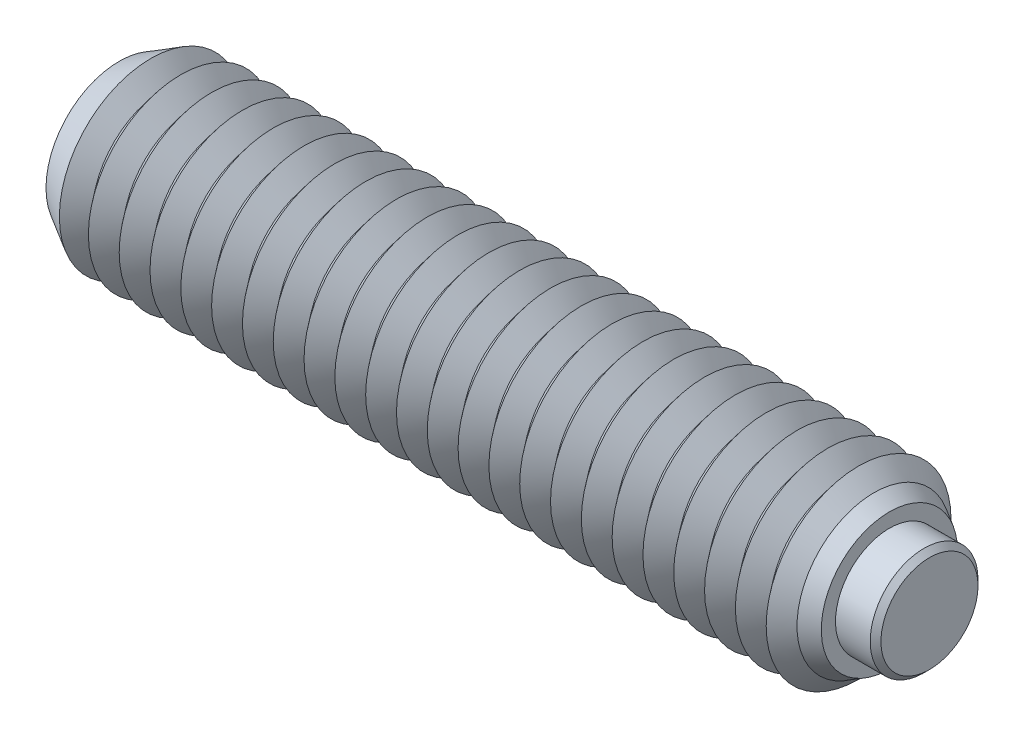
ISO-10303-21;
HEADER;
FILE_DESCRIPTION(('STEP AP214'),'2;1');
FILE_NAME('part.step','',(''),(''),'','','');
FILE_SCHEMA(('AUTOMOTIVE_DESIGN { 1 0 10303 214 1 1 1 1 }'));
ENDSEC;
DATA;
#1=APPLICATION_CONTEXT('core data for automotive mechanical design processes');
#2=APPLICATION_PROTOCOL_DEFINITION('international standard','automotive_design',2000,#1);
#3=PRODUCT_CONTEXT('',#1,'mechanical');
#4=PRODUCT('Part','Part','',(#3));
#5=PRODUCT_RELATED_PRODUCT_CATEGORY('part','',(#4));
#6=PRODUCT_DEFINITION_FORMATION('','',#4);
#7=PRODUCT_DEFINITION_CONTEXT('part definition',#1,'design');
#8=PRODUCT_DEFINITION('design','',#6,#7);
#9=PRODUCT_DEFINITION_SHAPE('','',#8);
#10=(LENGTH_UNIT() NAMED_UNIT(*) SI_UNIT(.MILLI.,.METRE.));
#11=(NAMED_UNIT(*) PLANE_ANGLE_UNIT() SI_UNIT($,.RADIAN.));
#12=(NAMED_UNIT(*) SI_UNIT($,.STERADIAN.) SOLID_ANGLE_UNIT());
#13=UNCERTAINTY_MEASURE_WITH_UNIT(LENGTH_MEASURE(1.E-05),#10,'distance_accuracy_value','');
#14=(GEOMETRIC_REPRESENTATION_CONTEXT(3) GLOBAL_UNCERTAINTY_ASSIGNED_CONTEXT((#13)) GLOBAL_UNIT_ASSIGNED_CONTEXT((#10,
#11,#12)) REPRESENTATION_CONTEXT('',''));
#15=CARTESIAN_POINT('',(0.,0.,0.));
#16=DIRECTION('',(0.,0.,1.));
#17=DIRECTION('',(1.,0.,0.));
#18=AXIS2_PLACEMENT_3D('',#15,#16,#17);
#19=CARTESIAN_POINT('',(1.8,0.,0.));
#20=DIRECTION('',(-1.,0.,0.));
#21=DIRECTION('',(0.,0.,1.));
#22=AXIS2_PLACEMENT_3D('',#19,#20,#21);
#23=CYLINDRICAL_SURFACE('',#22,1.75);
#24=CARTESIAN_POINT('',(1.625,0.,0.));
#25=DIRECTION('',(1.,0.,0.));
#26=DIRECTION('',(0.,0.,-1.));
#27=AXIS2_PLACEMENT_3D('',#24,#25,#26);
#28=CIRCLE('',#27,1.75);
#29=CARTESIAN_POINT('',(1.625,0.,-1.75));
#30=VERTEX_POINT('',#29);
#31=EDGE_CURVE('P0_E10',#30,#30,#28,.F.);
#32=ORIENTED_EDGE('',*,*,#31,.T.);
#33=EDGE_LOOP('',(#32));
#34=FACE_BOUND('',#33,.T.);
#35=CARTESIAN_POINT('',(-0.8,0.,0.));
#36=DIRECTION('',(1.,0.,0.));
#37=DIRECTION('',(0.,0.,-1.));
#38=AXIS2_PLACEMENT_3D('',#35,#36,#37);
#39=CIRCLE('',#38,1.75);
#40=CARTESIAN_POINT('',(-0.8,0.,-1.75));
#41=VERTEX_POINT('',#40);
#42=EDGE_CURVE('P0_E25',#41,#41,#39,.T.);
#43=ORIENTED_EDGE('',*,*,#42,.T.);
#44=EDGE_LOOP('',(#43));
#45=FACE_BOUND('',#44,.T.);
#46=ADVANCED_FACE('P0_F14',(#34,#45),#23,.T.);
#47=CARTESIAN_POINT('',(1.8,0.,0.));
#48=DIRECTION('',(1.,0.,0.));
#49=DIRECTION('',(0.,0.,-1.));
#50=AXIS2_PLACEMENT_3D('',#47,#48,#49);
#51=PLANE('',#50);
#52=CARTESIAN_POINT('',(1.8,0.,0.));
#53=DIRECTION('',(1.,0.,0.));
#54=DIRECTION('',(0.,0.,-1.));
#55=AXIS2_PLACEMENT_3D('',#52,#53,#54);
#56=CIRCLE('',#55,1.575);
#57=CARTESIAN_POINT('',(1.8,0.,-1.575));
#58=VERTEX_POINT('',#57);
#59=EDGE_CURVE('P0_E21',#58,#58,#56,.T.);
#60=ORIENTED_EDGE('',*,*,#59,.T.);
#61=EDGE_LOOP('',(#60));
#62=FACE_BOUND('',#61,.T.);
#63=ADVANCED_FACE('P0_F35',(#62),#51,.T.);
#64=CARTESIAN_POINT('',(-0.8,0.,0.));
#65=DIRECTION('',(1.,0.,0.));
#66=DIRECTION('',(0.,0.,-1.));
#67=AXIS2_PLACEMENT_3D('',#64,#65,#66);
#68=PLANE('',#67);
#69=ORIENTED_EDGE('',*,*,#42,.F.);
#70=EDGE_LOOP('',(#69));
#71=FACE_BOUND('',#70,.T.);
#72=ADVANCED_FACE('P0_F33',(#71),#68,.F.);
#73=CARTESIAN_POINT('',(1.8,0.,0.));
#74=DIRECTION('',(-1.,0.,0.));
#75=DIRECTION('',(0.,0.,1.));
#76=AXIS2_PLACEMENT_3D('',#73,#74,#75);
#77=CONICAL_SURFACE('',#76,1.575,0.785398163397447);
#78=ORIENTED_EDGE('',*,*,#31,.F.);
#79=EDGE_LOOP('',(#78));
#80=FACE_BOUND('',#79,.T.);
#81=ORIENTED_EDGE('',*,*,#59,.F.);
#82=EDGE_LOOP('',(#81));
#83=FACE_BOUND('',#82,.T.);
#84=ADVANCED_FACE('P0_F16',(#80,#83),#77,.T.);
#85=CLOSED_SHELL('',(#46,#63,#72,#84));
#86=MANIFOLD_SOLID_BREP('P0_B1',#85);
#87=CARTESIAN_POINT('',(-23.5,0.,0.));
#88=DIRECTION('',(-1.,0.,0.));
#89=DIRECTION('',(0.,0.,1.));
#90=AXIS2_PLACEMENT_3D('',#87,#88,#89);
#91=CONICAL_SURFACE('',#90,3.,0.895664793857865);
#92=CARTESIAN_POINT('',(-23.,0.,0.));
#93=DIRECTION('',(1.,0.,0.));
#94=DIRECTION('',(0.,0.,-1.));
#95=AXIS2_PLACEMENT_3D('',#92,#93,#94);
#96=CIRCLE('',#95,2.37550020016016);
#97=CARTESIAN_POINT('',(-23.,0.,-2.37550020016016));
#98=VERTEX_POINT('',#97);
#99=EDGE_CURVE('P1_E1087',#98,#98,#96,.T.);
#100=ORIENTED_EDGE('',*,*,#99,.F.);
#101=EDGE_LOOP('',(#100));
#102=FACE_BOUND('',#101,.T.);
#103=CARTESIAN_POINT('',(-23.4741837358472,0.,0.));
#104=DIRECTION('',(1.,0.,0.));
#105=DIRECTION('',(0.,0.,-1.));
#106=AXIS2_PLACEMENT_3D('',#103,#104,#105);
#107=CIRCLE('',#106,2.96775549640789);
#108=CARTESIAN_POINT('',(-23.4741837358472,0.,-2.96775549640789));
#109=VERTEX_POINT('',#108);
#110=EDGE_CURVE('P1_E1090',#109,#109,#107,.F.);
#111=ORIENTED_EDGE('',*,*,#110,.F.);
#112=EDGE_LOOP('',(#111));
#113=FACE_BOUND('',#112,.T.);
#114=ADVANCED_FACE('P1_F15',(#102,#113),#91,.T.);
#115=CARTESIAN_POINT('',(-1.,0.,0.));
#116=DIRECTION('',(1.,0.,0.));
#117=DIRECTION('',(0.,0.,-1.));
#118=AXIS2_PLACEMENT_3D('',#115,#116,#117);
#119=CONICAL_SURFACE('',#118,2.37550020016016,0.895664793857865);
#120=CARTESIAN_POINT('',(-0.5,0.,0.));
#121=DIRECTION('',(1.,0.,0.));
#122=DIRECTION('',(0.,0.,-1.));
#123=AXIS2_PLACEMENT_3D('',#120,#121,#122);
#124=CIRCLE('',#123,3.);
#125=CARTESIAN_POINT('',(-0.5,0.,-3.));
#126=VERTEX_POINT('',#125);
#127=EDGE_CURVE('P1_E951',#126,#126,#124,.T.);
#128=ORIENTED_EDGE('',*,*,#127,.F.);
#129=EDGE_LOOP('',(#128));
#130=FACE_BOUND('',#129,.T.);
#131=CARTESIAN_POINT('',(-1.,0.,0.));
#132=DIRECTION('',(1.,0.,0.));
#133=DIRECTION('',(0.,0.,-1.));
#134=AXIS2_PLACEMENT_3D('',#131,#132,#133);
#135=CIRCLE('',#134,2.37550020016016);
#136=CARTESIAN_POINT('',(-1.,0.,-2.37550020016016));
#137=VERTEX_POINT('',#136);
#138=EDGE_CURVE('P1_E952',#137,#137,#135,.T.);
#139=ORIENTED_EDGE('',*,*,#138,.T.);
#140=EDGE_LOOP('',(#139));
#141=FACE_BOUND('',#140,.T.);
#142=ADVANCED_FACE('P1_F222',(#130,#141),#119,.T.);
#143=CARTESIAN_POINT('',(-1.5,0.,0.));
#144=DIRECTION('',(-1.,0.,0.));
#145=DIRECTION('',(0.,0.,1.));
#146=AXIS2_PLACEMENT_3D('',#143,#144,#145);
#147=CONICAL_SURFACE('',#146,3.,0.895664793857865);
#148=ORIENTED_EDGE('',*,*,#138,.F.);
#149=EDGE_LOOP('',(#148));
#150=FACE_BOUND('',#149,.T.);
#151=CARTESIAN_POINT('',(-1.5,0.,0.));
#152=DIRECTION('',(1.,0.,0.));
#153=DIRECTION('',(0.,0.,-1.));
#154=AXIS2_PLACEMENT_3D('',#151,#152,#153);
#155=CIRCLE('',#154,3.);
#156=CARTESIAN_POINT('',(-1.5,0.,-3.));
#157=VERTEX_POINT('',#156);
#158=EDGE_CURVE('P1_E956',#157,#157,#155,.T.);
#159=ORIENTED_EDGE('',*,*,#158,.T.);
#160=EDGE_LOOP('',(#159));
#161=FACE_BOUND('',#160,.T.);
#162=ADVANCED_FACE('P1_F227',(#150,#161),#147,.T.);
#163=CARTESIAN_POINT('',(-0.8,0.,0.));
#164=DIRECTION('',(1.,0.,0.));
#165=DIRECTION('',(0.,1.,0.));
#166=AXIS2_PLACEMENT_3D('',#163,#164,#165);
#167=PLANE('',#166);
#168=CARTESIAN_POINT('',(-0.8,0.,0.));
#169=DIRECTION('',(1.,0.,0.));
#170=DIRECTION('',(0.,1.,0.));
#171=AXIS2_PLACEMENT_3D('',#168,#169,#170);
#172=CIRCLE('',#171,1.75);
#173=CARTESIAN_POINT('',(-0.8,1.75,0.));
#174=VERTEX_POINT('',#173);
#175=EDGE_CURVE('P1_E478',#174,#174,#172,.T.);
#176=ORIENTED_EDGE('',*,*,#175,.T.);
#177=EDGE_LOOP('',(#176));
#178=FACE_BOUND('',#177,.T.);
#179=ADVANCED_FACE('P1_F405',(#178),#167,.T.);
#180=CARTESIAN_POINT('',(-0.8,0.,0.));
#181=DIRECTION('',(1.,0.,0.));
#182=DIRECTION('',(0.,1.,0.));
#183=AXIS2_PLACEMENT_3D('',#180,#181,#182);
#184=CYLINDRICAL_SURFACE('',#183,1.75);
#185=ORIENTED_EDGE('',*,*,#175,.F.);
#186=EDGE_LOOP('',(#185));
#187=FACE_BOUND('',#186,.T.);
#188=CARTESIAN_POINT('',(0.5,0.,0.));
#189=DIRECTION('',(1.,0.,0.));
#190=DIRECTION('',(0.,1.,0.));
#191=AXIS2_PLACEMENT_3D('',#188,#189,#190);
#192=CIRCLE('',#191,1.75);
#193=CARTESIAN_POINT('',(0.5,1.75,0.));
#194=VERTEX_POINT('',#193);
#195=EDGE_CURVE('P1_E481',#194,#194,#192,.T.);
#196=ORIENTED_EDGE('',*,*,#195,.T.);
#197=EDGE_LOOP('',(#196));
#198=FACE_BOUND('',#197,.T.);
#199=ADVANCED_FACE('P1_F209',(#187,#198),#184,.F.);
#200=CARTESIAN_POINT('',(0.5,2.21132486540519,0.));
#201=DIRECTION('',(1.,0.,0.));
#202=DIRECTION('',(0.,1.,0.));
#203=AXIS2_PLACEMENT_3D('',#200,#201,#202);
#204=PLANE('',#203);
#205=ORIENTED_EDGE('',*,*,#195,.F.);
#206=EDGE_LOOP('',(#205));
#207=FACE_BOUND('',#206,.T.);
#208=CARTESIAN_POINT('',(0.5,0.,0.));
#209=DIRECTION('',(1.,0.,0.));
#210=DIRECTION('',(0.,1.,0.));
#211=AXIS2_PLACEMENT_3D('',#208,#209,#210);
#212=CIRCLE('',#211,2.21132486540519);
#213=CARTESIAN_POINT('',(0.5,2.21132486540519,0.));
#214=VERTEX_POINT('',#213);
#215=EDGE_CURVE('P1_E121',#214,#214,#212,.T.);
#216=ORIENTED_EDGE('',*,*,#215,.T.);
#217=EDGE_LOOP('',(#216));
#218=FACE_BOUND('',#217,.T.);
#219=ADVANCED_FACE('P1_F206',(#207,#218),#204,.T.);
#220=CARTESIAN_POINT('',(0.5,0.,0.));
#221=DIRECTION('',(-1.,0.,0.));
#222=DIRECTION('',(0.,-1.,0.));
#223=AXIS2_PLACEMENT_3D('',#220,#221,#222);
#224=CONICAL_SURFACE('',#223,2.21132486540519,0.523598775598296);
#225=CARTESIAN_POINT('',(0.,0.,0.));
#226=DIRECTION('',(1.,0.,0.));
#227=DIRECTION('',(0.,0.,-1.));
#228=AXIS2_PLACEMENT_3D('',#225,#226,#227);
#229=CIRCLE('',#228,2.5);
#230=CARTESIAN_POINT('',(0.,0.,-2.5));
#231=VERTEX_POINT('',#230);
#232=EDGE_CURVE('P1_E469',#231,#231,#229,.T.);
#233=ORIENTED_EDGE('',*,*,#232,.T.);
#234=EDGE_LOOP('',(#233));
#235=FACE_BOUND('',#234,.T.);
#236=ORIENTED_EDGE('',*,*,#215,.F.);
#237=EDGE_LOOP('',(#236));
#238=FACE_BOUND('',#237,.T.);
#239=ADVANCED_FACE('P1_F203',(#235,#238),#224,.T.);
#240=CARTESIAN_POINT('',(0.,0.,0.));
#241=DIRECTION('',(-1.,0.,0.));
#242=DIRECTION('',(0.,0.,1.));
#243=AXIS2_PLACEMENT_3D('',#240,#241,#242);
#244=CONICAL_SURFACE('',#243,2.5,0.785398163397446);
#245=ORIENTED_EDGE('',*,*,#127,.T.);
#246=EDGE_LOOP('',(#245));
#247=FACE_BOUND('',#246,.T.);
#248=ORIENTED_EDGE('',*,*,#232,.F.);
#249=EDGE_LOOP('',(#248));
#250=FACE_BOUND('',#249,.T.);
#251=ADVANCED_FACE('P1_F17',(#247,#250),#244,.T.);
#252=CARTESIAN_POINT('',(-2.,0.,0.));
#253=DIRECTION('',(1.,0.,0.));
#254=DIRECTION('',(0.,0.,-1.));
#255=AXIS2_PLACEMENT_3D('',#252,#253,#254);
#256=CONICAL_SURFACE('',#255,2.37550020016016,0.895664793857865);
#257=ORIENTED_EDGE('',*,*,#158,.F.);
#258=EDGE_LOOP('',(#257));
#259=FACE_BOUND('',#258,.T.);
#260=CARTESIAN_POINT('',(-2.,0.,0.));
#261=DIRECTION('',(1.,0.,0.));
#262=DIRECTION('',(0.,0.,-1.));
#263=AXIS2_PLACEMENT_3D('',#260,#261,#262);
#264=CIRCLE('',#263,2.37550020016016);
#265=CARTESIAN_POINT('',(-2.,0.,-2.37550020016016));
#266=VERTEX_POINT('',#265);
#267=EDGE_CURVE('P1_E961',#266,#266,#264,.T.);
#268=ORIENTED_EDGE('',*,*,#267,.T.);
#269=EDGE_LOOP('',(#268));
#270=FACE_BOUND('',#269,.T.);
#271=ADVANCED_FACE('P1_F399',(#259,#270),#256,.T.);
#272=CARTESIAN_POINT('',(-2.5,0.,0.));
#273=DIRECTION('',(-1.,0.,0.));
#274=DIRECTION('',(0.,0.,1.));
#275=AXIS2_PLACEMENT_3D('',#272,#273,#274);
#276=CONICAL_SURFACE('',#275,3.,0.895664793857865);
#277=ORIENTED_EDGE('',*,*,#267,.F.);
#278=EDGE_LOOP('',(#277));
#279=FACE_BOUND('',#278,.T.);
#280=CARTESIAN_POINT('',(-2.5,0.,0.));
#281=DIRECTION('',(1.,0.,0.));
#282=DIRECTION('',(0.,0.,-1.));
#283=AXIS2_PLACEMENT_3D('',#280,#281,#282);
#284=CIRCLE('',#283,3.);
#285=CARTESIAN_POINT('',(-2.5,0.,-3.));
#286=VERTEX_POINT('',#285);
#287=EDGE_CURVE('P1_E964',#286,#286,#284,.T.);
#288=ORIENTED_EDGE('',*,*,#287,.T.);
#289=EDGE_LOOP('',(#288));
#290=FACE_BOUND('',#289,.T.);
#291=ADVANCED_FACE('P1_F395',(#279,#290),#276,.T.);
#292=CARTESIAN_POINT('',(-3.,0.,0.));
#293=DIRECTION('',(1.,0.,0.));
#294=DIRECTION('',(0.,0.,-1.));
#295=AXIS2_PLACEMENT_3D('',#292,#293,#294);
#296=CONICAL_SURFACE('',#295,2.37550020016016,0.895664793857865);
#297=ORIENTED_EDGE('',*,*,#287,.F.);
#298=EDGE_LOOP('',(#297));
#299=FACE_BOUND('',#298,.T.);
#300=CARTESIAN_POINT('',(-3.,0.,0.));
#301=DIRECTION('',(1.,0.,0.));
#302=DIRECTION('',(0.,0.,-1.));
#303=AXIS2_PLACEMENT_3D('',#300,#301,#302);
#304=CIRCLE('',#303,2.37550020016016);
#305=CARTESIAN_POINT('',(-3.,0.,-2.37550020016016));
#306=VERTEX_POINT('',#305);
#307=EDGE_CURVE('P1_E967',#306,#306,#304,.T.);
#308=ORIENTED_EDGE('',*,*,#307,.T.);
#309=EDGE_LOOP('',(#308));
#310=FACE_BOUND('',#309,.T.);
#311=ADVANCED_FACE('P1_F391',(#299,#310),#296,.T.);
#312=CARTESIAN_POINT('',(-3.5,0.,0.));
#313=DIRECTION('',(-1.,0.,0.));
#314=DIRECTION('',(0.,0.,1.));
#315=AXIS2_PLACEMENT_3D('',#312,#313,#314);
#316=CONICAL_SURFACE('',#315,3.,0.895664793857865);
#317=ORIENTED_EDGE('',*,*,#307,.F.);
#318=EDGE_LOOP('',(#317));
#319=FACE_BOUND('',#318,.T.);
#320=CARTESIAN_POINT('',(-3.5,0.,0.));
#321=DIRECTION('',(1.,0.,0.));
#322=DIRECTION('',(0.,0.,-1.));
#323=AXIS2_PLACEMENT_3D('',#320,#321,#322);
#324=CIRCLE('',#323,3.);
#325=CARTESIAN_POINT('',(-3.5,0.,-3.));
#326=VERTEX_POINT('',#325);
#327=EDGE_CURVE('P1_E970',#326,#326,#324,.T.);
#328=ORIENTED_EDGE('',*,*,#327,.T.);
#329=EDGE_LOOP('',(#328));
#330=FACE_BOUND('',#329,.T.);
#331=ADVANCED_FACE('P1_F387',(#319,#330),#316,.T.);
#332=CARTESIAN_POINT('',(-4.,0.,0.));
#333=DIRECTION('',(1.,0.,0.));
#334=DIRECTION('',(0.,0.,-1.));
#335=AXIS2_PLACEMENT_3D('',#332,#333,#334);
#336=CONICAL_SURFACE('',#335,2.37550020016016,0.895664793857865);
#337=ORIENTED_EDGE('',*,*,#327,.F.);
#338=EDGE_LOOP('',(#337));
#339=FACE_BOUND('',#338,.T.);
#340=CARTESIAN_POINT('',(-4.,0.,0.));
#341=DIRECTION('',(1.,0.,0.));
#342=DIRECTION('',(0.,0.,-1.));
#343=AXIS2_PLACEMENT_3D('',#340,#341,#342);
#344=CIRCLE('',#343,2.37550020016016);
#345=CARTESIAN_POINT('',(-4.,0.,-2.37550020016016));
#346=VERTEX_POINT('',#345);
#347=EDGE_CURVE('P1_E973',#346,#346,#344,.T.);
#348=ORIENTED_EDGE('',*,*,#347,.T.);
#349=EDGE_LOOP('',(#348));
#350=FACE_BOUND('',#349,.T.);
#351=ADVANCED_FACE('P1_F383',(#339,#350),#336,.T.);
#352=CARTESIAN_POINT('',(-4.5,0.,0.));
#353=DIRECTION('',(-1.,0.,0.));
#354=DIRECTION('',(0.,0.,1.));
#355=AXIS2_PLACEMENT_3D('',#352,#353,#354);
#356=CONICAL_SURFACE('',#355,3.,0.895664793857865);
#357=ORIENTED_EDGE('',*,*,#347,.F.);
#358=EDGE_LOOP('',(#357));
#359=FACE_BOUND('',#358,.T.);
#360=CARTESIAN_POINT('',(-4.5,0.,0.));
#361=DIRECTION('',(1.,0.,0.));
#362=DIRECTION('',(0.,0.,-1.));
#363=AXIS2_PLACEMENT_3D('',#360,#361,#362);
#364=CIRCLE('',#363,3.);
#365=CARTESIAN_POINT('',(-4.5,0.,-3.));
#366=VERTEX_POINT('',#365);
#367=EDGE_CURVE('P1_E976',#366,#366,#364,.T.);
#368=ORIENTED_EDGE('',*,*,#367,.T.);
#369=EDGE_LOOP('',(#368));
#370=FACE_BOUND('',#369,.T.);
#371=ADVANCED_FACE('P1_F379',(#359,#370),#356,.T.);
#372=CARTESIAN_POINT('',(-5.,0.,0.));
#373=DIRECTION('',(1.,0.,0.));
#374=DIRECTION('',(0.,0.,-1.));
#375=AXIS2_PLACEMENT_3D('',#372,#373,#374);
#376=CONICAL_SURFACE('',#375,2.37550020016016,0.895664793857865);
#377=ORIENTED_EDGE('',*,*,#367,.F.);
#378=EDGE_LOOP('',(#377));
#379=FACE_BOUND('',#378,.T.);
#380=CARTESIAN_POINT('',(-5.,0.,0.));
#381=DIRECTION('',(1.,0.,0.));
#382=DIRECTION('',(0.,0.,-1.));
#383=AXIS2_PLACEMENT_3D('',#380,#381,#382);
#384=CIRCLE('',#383,2.37550020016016);
#385=CARTESIAN_POINT('',(-5.,0.,-2.37550020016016));
#386=VERTEX_POINT('',#385);
#387=EDGE_CURVE('P1_E979',#386,#386,#384,.T.);
#388=ORIENTED_EDGE('',*,*,#387,.T.);
#389=EDGE_LOOP('',(#388));
#390=FACE_BOUND('',#389,.T.);
#391=ADVANCED_FACE('P1_F375',(#379,#390),#376,.T.);
#392=CARTESIAN_POINT('',(-5.5,0.,0.));
#393=DIRECTION('',(-1.,0.,0.));
#394=DIRECTION('',(0.,0.,1.));
#395=AXIS2_PLACEMENT_3D('',#392,#393,#394);
#396=CONICAL_SURFACE('',#395,3.,0.895664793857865);
#397=ORIENTED_EDGE('',*,*,#387,.F.);
#398=EDGE_LOOP('',(#397));
#399=FACE_BOUND('',#398,.T.);
#400=CARTESIAN_POINT('',(-5.5,0.,0.));
#401=DIRECTION('',(1.,0.,0.));
#402=DIRECTION('',(0.,0.,-1.));
#403=AXIS2_PLACEMENT_3D('',#400,#401,#402);
#404=CIRCLE('',#403,3.);
#405=CARTESIAN_POINT('',(-5.5,0.,-3.));
#406=VERTEX_POINT('',#405);
#407=EDGE_CURVE('P1_E982',#406,#406,#404,.T.);
#408=ORIENTED_EDGE('',*,*,#407,.T.);
#409=EDGE_LOOP('',(#408));
#410=FACE_BOUND('',#409,.T.);
#411=ADVANCED_FACE('P1_F371',(#399,#410),#396,.T.);
#412=CARTESIAN_POINT('',(-6.,0.,0.));
#413=DIRECTION('',(1.,0.,0.));
#414=DIRECTION('',(0.,0.,-1.));
#415=AXIS2_PLACEMENT_3D('',#412,#413,#414);
#416=CONICAL_SURFACE('',#415,2.37550020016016,0.895664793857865);
#417=ORIENTED_EDGE('',*,*,#407,.F.);
#418=EDGE_LOOP('',(#417));
#419=FACE_BOUND('',#418,.T.);
#420=CARTESIAN_POINT('',(-6.,0.,0.));
#421=DIRECTION('',(1.,0.,0.));
#422=DIRECTION('',(0.,0.,-1.));
#423=AXIS2_PLACEMENT_3D('',#420,#421,#422);
#424=CIRCLE('',#423,2.37550020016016);
#425=CARTESIAN_POINT('',(-6.,0.,-2.37550020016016));
#426=VERTEX_POINT('',#425);
#427=EDGE_CURVE('P1_E985',#426,#426,#424,.T.);
#428=ORIENTED_EDGE('',*,*,#427,.T.);
#429=EDGE_LOOP('',(#428));
#430=FACE_BOUND('',#429,.T.);
#431=ADVANCED_FACE('P1_F367',(#419,#430),#416,.T.);
#432=CARTESIAN_POINT('',(-6.5,0.,0.));
#433=DIRECTION('',(-1.,0.,0.));
#434=DIRECTION('',(0.,0.,1.));
#435=AXIS2_PLACEMENT_3D('',#432,#433,#434);
#436=CONICAL_SURFACE('',#435,3.,0.895664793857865);
#437=ORIENTED_EDGE('',*,*,#427,.F.);
#438=EDGE_LOOP('',(#437));
#439=FACE_BOUND('',#438,.T.);
#440=CARTESIAN_POINT('',(-6.5,0.,0.));
#441=DIRECTION('',(1.,0.,0.));
#442=DIRECTION('',(0.,0.,-1.));
#443=AXIS2_PLACEMENT_3D('',#440,#441,#442);
#444=CIRCLE('',#443,3.);
#445=CARTESIAN_POINT('',(-6.5,0.,-3.));
#446=VERTEX_POINT('',#445);
#447=EDGE_CURVE('P1_E988',#446,#446,#444,.T.);
#448=ORIENTED_EDGE('',*,*,#447,.T.);
#449=EDGE_LOOP('',(#448));
#450=FACE_BOUND('',#449,.T.);
#451=ADVANCED_FACE('P1_F363',(#439,#450),#436,.T.);
#452=CARTESIAN_POINT('',(-7.,0.,0.));
#453=DIRECTION('',(1.,0.,0.));
#454=DIRECTION('',(0.,0.,-1.));
#455=AXIS2_PLACEMENT_3D('',#452,#453,#454);
#456=CONICAL_SURFACE('',#455,2.37550020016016,0.895664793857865);
#457=ORIENTED_EDGE('',*,*,#447,.F.);
#458=EDGE_LOOP('',(#457));
#459=FACE_BOUND('',#458,.T.);
#460=CARTESIAN_POINT('',(-7.,0.,0.));
#461=DIRECTION('',(1.,0.,0.));
#462=DIRECTION('',(0.,0.,-1.));
#463=AXIS2_PLACEMENT_3D('',#460,#461,#462);
#464=CIRCLE('',#463,2.37550020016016);
#465=CARTESIAN_POINT('',(-7.,0.,-2.37550020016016));
#466=VERTEX_POINT('',#465);
#467=EDGE_CURVE('P1_E991',#466,#466,#464,.T.);
#468=ORIENTED_EDGE('',*,*,#467,.T.);
#469=EDGE_LOOP('',(#468));
#470=FACE_BOUND('',#469,.T.);
#471=ADVANCED_FACE('P1_F359',(#459,#470),#456,.T.);
#472=CARTESIAN_POINT('',(-7.5,0.,0.));
#473=DIRECTION('',(-1.,0.,0.));
#474=DIRECTION('',(0.,0.,1.));
#475=AXIS2_PLACEMENT_3D('',#472,#473,#474);
#476=CONICAL_SURFACE('',#475,3.,0.895664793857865);
#477=ORIENTED_EDGE('',*,*,#467,.F.);
#478=EDGE_LOOP('',(#477));
#479=FACE_BOUND('',#478,.T.);
#480=CARTESIAN_POINT('',(-7.5,0.,0.));
#481=DIRECTION('',(1.,0.,0.));
#482=DIRECTION('',(0.,0.,-1.));
#483=AXIS2_PLACEMENT_3D('',#480,#481,#482);
#484=CIRCLE('',#483,3.);
#485=CARTESIAN_POINT('',(-7.5,0.,-3.));
#486=VERTEX_POINT('',#485);
#487=EDGE_CURVE('P1_E994',#486,#486,#484,.T.);
#488=ORIENTED_EDGE('',*,*,#487,.T.);
#489=EDGE_LOOP('',(#488));
#490=FACE_BOUND('',#489,.T.);
#491=ADVANCED_FACE('P1_F355',(#479,#490),#476,.T.);
#492=CARTESIAN_POINT('',(-8.,0.,0.));
#493=DIRECTION('',(1.,0.,0.));
#494=DIRECTION('',(0.,0.,-1.));
#495=AXIS2_PLACEMENT_3D('',#492,#493,#494);
#496=CONICAL_SURFACE('',#495,2.37550020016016,0.895664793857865);
#497=ORIENTED_EDGE('',*,*,#487,.F.);
#498=EDGE_LOOP('',(#497));
#499=FACE_BOUND('',#498,.T.);
#500=CARTESIAN_POINT('',(-8.,0.,0.));
#501=DIRECTION('',(1.,0.,0.));
#502=DIRECTION('',(0.,0.,-1.));
#503=AXIS2_PLACEMENT_3D('',#500,#501,#502);
#504=CIRCLE('',#503,2.37550020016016);
#505=CARTESIAN_POINT('',(-8.,0.,-2.37550020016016));
#506=VERTEX_POINT('',#505);
#507=EDGE_CURVE('P1_E997',#506,#506,#504,.T.);
#508=ORIENTED_EDGE('',*,*,#507,.T.);
#509=EDGE_LOOP('',(#508));
#510=FACE_BOUND('',#509,.T.);
#511=ADVANCED_FACE('P1_F351',(#499,#510),#496,.T.);
#512=CARTESIAN_POINT('',(-8.5,0.,0.));
#513=DIRECTION('',(-1.,0.,0.));
#514=DIRECTION('',(0.,0.,1.));
#515=AXIS2_PLACEMENT_3D('',#512,#513,#514);
#516=CONICAL_SURFACE('',#515,3.,0.895664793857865);
#517=ORIENTED_EDGE('',*,*,#507,.F.);
#518=EDGE_LOOP('',(#517));
#519=FACE_BOUND('',#518,.T.);
#520=CARTESIAN_POINT('',(-8.5,0.,0.));
#521=DIRECTION('',(1.,0.,0.));
#522=DIRECTION('',(0.,0.,-1.));
#523=AXIS2_PLACEMENT_3D('',#520,#521,#522);
#524=CIRCLE('',#523,3.);
#525=CARTESIAN_POINT('',(-8.5,0.,-3.));
#526=VERTEX_POINT('',#525);
#527=EDGE_CURVE('P1_E1000',#526,#526,#524,.T.);
#528=ORIENTED_EDGE('',*,*,#527,.T.);
#529=EDGE_LOOP('',(#528));
#530=FACE_BOUND('',#529,.T.);
#531=ADVANCED_FACE('P1_F347',(#519,#530),#516,.T.);
#532=CARTESIAN_POINT('',(-9.,0.,0.));
#533=DIRECTION('',(1.,0.,0.));
#534=DIRECTION('',(0.,0.,-1.));
#535=AXIS2_PLACEMENT_3D('',#532,#533,#534);
#536=CONICAL_SURFACE('',#535,2.37550020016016,0.895664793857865);
#537=ORIENTED_EDGE('',*,*,#527,.F.);
#538=EDGE_LOOP('',(#537));
#539=FACE_BOUND('',#538,.T.);
#540=CARTESIAN_POINT('',(-9.,0.,0.));
#541=DIRECTION('',(1.,0.,0.));
#542=DIRECTION('',(0.,0.,-1.));
#543=AXIS2_PLACEMENT_3D('',#540,#541,#542);
#544=CIRCLE('',#543,2.37550020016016);
#545=CARTESIAN_POINT('',(-9.,0.,-2.37550020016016));
#546=VERTEX_POINT('',#545);
#547=EDGE_CURVE('P1_E1003',#546,#546,#544,.T.);
#548=ORIENTED_EDGE('',*,*,#547,.T.);
#549=EDGE_LOOP('',(#548));
#550=FACE_BOUND('',#549,.T.);
#551=ADVANCED_FACE('P1_F343',(#539,#550),#536,.T.);
#552=CARTESIAN_POINT('',(-9.5,0.,0.));
#553=DIRECTION('',(-1.,0.,0.));
#554=DIRECTION('',(0.,0.,1.));
#555=AXIS2_PLACEMENT_3D('',#552,#553,#554);
#556=CONICAL_SURFACE('',#555,3.,0.895664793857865);
#557=ORIENTED_EDGE('',*,*,#547,.F.);
#558=EDGE_LOOP('',(#557));
#559=FACE_BOUND('',#558,.T.);
#560=CARTESIAN_POINT('',(-9.5,0.,0.));
#561=DIRECTION('',(1.,0.,0.));
#562=DIRECTION('',(0.,0.,-1.));
#563=AXIS2_PLACEMENT_3D('',#560,#561,#562);
#564=CIRCLE('',#563,3.);
#565=CARTESIAN_POINT('',(-9.5,0.,-3.));
#566=VERTEX_POINT('',#565);
#567=EDGE_CURVE('P1_E1006',#566,#566,#564,.T.);
#568=ORIENTED_EDGE('',*,*,#567,.T.);
#569=EDGE_LOOP('',(#568));
#570=FACE_BOUND('',#569,.T.);
#571=ADVANCED_FACE('P1_F339',(#559,#570),#556,.T.);
#572=CARTESIAN_POINT('',(-10.,0.,0.));
#573=DIRECTION('',(1.,0.,0.));
#574=DIRECTION('',(0.,0.,-1.));
#575=AXIS2_PLACEMENT_3D('',#572,#573,#574);
#576=CONICAL_SURFACE('',#575,2.37550020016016,0.895664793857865);
#577=ORIENTED_EDGE('',*,*,#567,.F.);
#578=EDGE_LOOP('',(#577));
#579=FACE_BOUND('',#578,.T.);
#580=CARTESIAN_POINT('',(-10.,0.,0.));
#581=DIRECTION('',(1.,0.,0.));
#582=DIRECTION('',(0.,0.,-1.));
#583=AXIS2_PLACEMENT_3D('',#580,#581,#582);
#584=CIRCLE('',#583,2.37550020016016);
#585=CARTESIAN_POINT('',(-10.,0.,-2.37550020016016));
#586=VERTEX_POINT('',#585);
#587=EDGE_CURVE('P1_E1009',#586,#586,#584,.T.);
#588=ORIENTED_EDGE('',*,*,#587,.T.);
#589=EDGE_LOOP('',(#588));
#590=FACE_BOUND('',#589,.T.);
#591=ADVANCED_FACE('P1_F335',(#579,#590),#576,.T.);
#592=CARTESIAN_POINT('',(-10.5,0.,0.));
#593=DIRECTION('',(-1.,0.,0.));
#594=DIRECTION('',(0.,0.,1.));
#595=AXIS2_PLACEMENT_3D('',#592,#593,#594);
#596=CONICAL_SURFACE('',#595,3.,0.895664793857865);
#597=ORIENTED_EDGE('',*,*,#587,.F.);
#598=EDGE_LOOP('',(#597));
#599=FACE_BOUND('',#598,.T.);
#600=CARTESIAN_POINT('',(-10.5,0.,0.));
#601=DIRECTION('',(1.,0.,0.));
#602=DIRECTION('',(0.,0.,-1.));
#603=AXIS2_PLACEMENT_3D('',#600,#601,#602);
#604=CIRCLE('',#603,3.);
#605=CARTESIAN_POINT('',(-10.5,0.,-3.));
#606=VERTEX_POINT('',#605);
#607=EDGE_CURVE('P1_E1012',#606,#606,#604,.T.);
#608=ORIENTED_EDGE('',*,*,#607,.T.);
#609=EDGE_LOOP('',(#608));
#610=FACE_BOUND('',#609,.T.);
#611=ADVANCED_FACE('P1_F331',(#599,#610),#596,.T.);
#612=CARTESIAN_POINT('',(-11.,0.,0.));
#613=DIRECTION('',(1.,0.,0.));
#614=DIRECTION('',(0.,0.,-1.));
#615=AXIS2_PLACEMENT_3D('',#612,#613,#614);
#616=CONICAL_SURFACE('',#615,2.37550020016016,0.895664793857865);
#617=ORIENTED_EDGE('',*,*,#607,.F.);
#618=EDGE_LOOP('',(#617));
#619=FACE_BOUND('',#618,.T.);
#620=CARTESIAN_POINT('',(-11.,0.,0.));
#621=DIRECTION('',(1.,0.,0.));
#622=DIRECTION('',(0.,0.,-1.));
#623=AXIS2_PLACEMENT_3D('',#620,#621,#622);
#624=CIRCLE('',#623,2.37550020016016);
#625=CARTESIAN_POINT('',(-11.,0.,-2.37550020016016));
#626=VERTEX_POINT('',#625);
#627=EDGE_CURVE('P1_E1015',#626,#626,#624,.T.);
#628=ORIENTED_EDGE('',*,*,#627,.T.);
#629=EDGE_LOOP('',(#628));
#630=FACE_BOUND('',#629,.T.);
#631=ADVANCED_FACE('P1_F327',(#619,#630),#616,.T.);
#632=CARTESIAN_POINT('',(-11.5,0.,0.));
#633=DIRECTION('',(-1.,0.,0.));
#634=DIRECTION('',(0.,0.,1.));
#635=AXIS2_PLACEMENT_3D('',#632,#633,#634);
#636=CONICAL_SURFACE('',#635,3.,0.895664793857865);
#637=ORIENTED_EDGE('',*,*,#627,.F.);
#638=EDGE_LOOP('',(#637));
#639=FACE_BOUND('',#638,.T.);
#640=CARTESIAN_POINT('',(-11.5,0.,0.));
#641=DIRECTION('',(1.,0.,0.));
#642=DIRECTION('',(0.,0.,-1.));
#643=AXIS2_PLACEMENT_3D('',#640,#641,#642);
#644=CIRCLE('',#643,3.);
#645=CARTESIAN_POINT('',(-11.5,0.,-3.));
#646=VERTEX_POINT('',#645);
#647=EDGE_CURVE('P1_E1018',#646,#646,#644,.T.);
#648=ORIENTED_EDGE('',*,*,#647,.T.);
#649=EDGE_LOOP('',(#648));
#650=FACE_BOUND('',#649,.T.);
#651=ADVANCED_FACE('P1_F323',(#639,#650),#636,.T.);
#652=CARTESIAN_POINT('',(-12.,0.,0.));
#653=DIRECTION('',(1.,0.,0.));
#654=DIRECTION('',(0.,0.,-1.));
#655=AXIS2_PLACEMENT_3D('',#652,#653,#654);
#656=CONICAL_SURFACE('',#655,2.37550020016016,0.895664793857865);
#657=ORIENTED_EDGE('',*,*,#647,.F.);
#658=EDGE_LOOP('',(#657));
#659=FACE_BOUND('',#658,.T.);
#660=CARTESIAN_POINT('',(-12.,0.,0.));
#661=DIRECTION('',(1.,0.,0.));
#662=DIRECTION('',(0.,0.,-1.));
#663=AXIS2_PLACEMENT_3D('',#660,#661,#662);
#664=CIRCLE('',#663,2.37550020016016);
#665=CARTESIAN_POINT('',(-12.,0.,-2.37550020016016));
#666=VERTEX_POINT('',#665);
#667=EDGE_CURVE('P1_E1021',#666,#666,#664,.T.);
#668=ORIENTED_EDGE('',*,*,#667,.T.);
#669=EDGE_LOOP('',(#668));
#670=FACE_BOUND('',#669,.T.);
#671=ADVANCED_FACE('P1_F319',(#659,#670),#656,.T.);
#672=CARTESIAN_POINT('',(-12.5,0.,0.));
#673=DIRECTION('',(-1.,0.,0.));
#674=DIRECTION('',(0.,0.,1.));
#675=AXIS2_PLACEMENT_3D('',#672,#673,#674);
#676=CONICAL_SURFACE('',#675,3.,0.895664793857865);
#677=ORIENTED_EDGE('',*,*,#667,.F.);
#678=EDGE_LOOP('',(#677));
#679=FACE_BOUND('',#678,.T.);
#680=CARTESIAN_POINT('',(-12.5,0.,0.));
#681=DIRECTION('',(1.,0.,0.));
#682=DIRECTION('',(0.,0.,-1.));
#683=AXIS2_PLACEMENT_3D('',#680,#681,#682);
#684=CIRCLE('',#683,3.);
#685=CARTESIAN_POINT('',(-12.5,0.,-3.));
#686=VERTEX_POINT('',#685);
#687=EDGE_CURVE('P1_E1024',#686,#686,#684,.T.);
#688=ORIENTED_EDGE('',*,*,#687,.T.);
#689=EDGE_LOOP('',(#688));
#690=FACE_BOUND('',#689,.T.);
#691=ADVANCED_FACE('P1_F315',(#679,#690),#676,.T.);
#692=CARTESIAN_POINT('',(-13.,0.,0.));
#693=DIRECTION('',(1.,0.,0.));
#694=DIRECTION('',(0.,0.,-1.));
#695=AXIS2_PLACEMENT_3D('',#692,#693,#694);
#696=CONICAL_SURFACE('',#695,2.37550020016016,0.895664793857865);
#697=ORIENTED_EDGE('',*,*,#687,.F.);
#698=EDGE_LOOP('',(#697));
#699=FACE_BOUND('',#698,.T.);
#700=CARTESIAN_POINT('',(-13.,0.,0.));
#701=DIRECTION('',(1.,0.,0.));
#702=DIRECTION('',(0.,0.,-1.));
#703=AXIS2_PLACEMENT_3D('',#700,#701,#702);
#704=CIRCLE('',#703,2.37550020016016);
#705=CARTESIAN_POINT('',(-13.,0.,-2.37550020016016));
#706=VERTEX_POINT('',#705);
#707=EDGE_CURVE('P1_E1027',#706,#706,#704,.T.);
#708=ORIENTED_EDGE('',*,*,#707,.T.);
#709=EDGE_LOOP('',(#708));
#710=FACE_BOUND('',#709,.T.);
#711=ADVANCED_FACE('P1_F311',(#699,#710),#696,.T.);
#712=CARTESIAN_POINT('',(-13.5,0.,0.));
#713=DIRECTION('',(-1.,0.,0.));
#714=DIRECTION('',(0.,0.,1.));
#715=AXIS2_PLACEMENT_3D('',#712,#713,#714);
#716=CONICAL_SURFACE('',#715,3.,0.895664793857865);
#717=ORIENTED_EDGE('',*,*,#707,.F.);
#718=EDGE_LOOP('',(#717));
#719=FACE_BOUND('',#718,.T.);
#720=CARTESIAN_POINT('',(-13.5,0.,0.));
#721=DIRECTION('',(1.,0.,0.));
#722=DIRECTION('',(0.,0.,-1.));
#723=AXIS2_PLACEMENT_3D('',#720,#721,#722);
#724=CIRCLE('',#723,3.);
#725=CARTESIAN_POINT('',(-13.5,0.,-3.));
#726=VERTEX_POINT('',#725);
#727=EDGE_CURVE('P1_E1030',#726,#726,#724,.T.);
#728=ORIENTED_EDGE('',*,*,#727,.T.);
#729=EDGE_LOOP('',(#728));
#730=FACE_BOUND('',#729,.T.);
#731=ADVANCED_FACE('P1_F307',(#719,#730),#716,.T.);
#732=CARTESIAN_POINT('',(-14.,0.,0.));
#733=DIRECTION('',(1.,0.,0.));
#734=DIRECTION('',(0.,0.,-1.));
#735=AXIS2_PLACEMENT_3D('',#732,#733,#734);
#736=CONICAL_SURFACE('',#735,2.37550020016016,0.895664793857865);
#737=ORIENTED_EDGE('',*,*,#727,.F.);
#738=EDGE_LOOP('',(#737));
#739=FACE_BOUND('',#738,.T.);
#740=CARTESIAN_POINT('',(-14.,0.,0.));
#741=DIRECTION('',(1.,0.,0.));
#742=DIRECTION('',(0.,0.,-1.));
#743=AXIS2_PLACEMENT_3D('',#740,#741,#742);
#744=CIRCLE('',#743,2.37550020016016);
#745=CARTESIAN_POINT('',(-14.,0.,-2.37550020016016));
#746=VERTEX_POINT('',#745);
#747=EDGE_CURVE('P1_E1033',#746,#746,#744,.T.);
#748=ORIENTED_EDGE('',*,*,#747,.T.);
#749=EDGE_LOOP('',(#748));
#750=FACE_BOUND('',#749,.T.);
#751=ADVANCED_FACE('P1_F303',(#739,#750),#736,.T.);
#752=CARTESIAN_POINT('',(-14.5,0.,0.));
#753=DIRECTION('',(-1.,0.,0.));
#754=DIRECTION('',(0.,0.,1.));
#755=AXIS2_PLACEMENT_3D('',#752,#753,#754);
#756=CONICAL_SURFACE('',#755,3.,0.895664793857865);
#757=ORIENTED_EDGE('',*,*,#747,.F.);
#758=EDGE_LOOP('',(#757));
#759=FACE_BOUND('',#758,.T.);
#760=CARTESIAN_POINT('',(-14.5,0.,0.));
#761=DIRECTION('',(1.,0.,0.));
#762=DIRECTION('',(0.,0.,-1.));
#763=AXIS2_PLACEMENT_3D('',#760,#761,#762);
#764=CIRCLE('',#763,3.);
#765=CARTESIAN_POINT('',(-14.5,0.,-3.));
#766=VERTEX_POINT('',#765);
#767=EDGE_CURVE('P1_E1036',#766,#766,#764,.T.);
#768=ORIENTED_EDGE('',*,*,#767,.T.);
#769=EDGE_LOOP('',(#768));
#770=FACE_BOUND('',#769,.T.);
#771=ADVANCED_FACE('P1_F299',(#759,#770),#756,.T.);
#772=CARTESIAN_POINT('',(-15.,0.,0.));
#773=DIRECTION('',(1.,0.,0.));
#774=DIRECTION('',(0.,0.,-1.));
#775=AXIS2_PLACEMENT_3D('',#772,#773,#774);
#776=CONICAL_SURFACE('',#775,2.37550020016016,0.895664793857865);
#777=ORIENTED_EDGE('',*,*,#767,.F.);
#778=EDGE_LOOP('',(#777));
#779=FACE_BOUND('',#778,.T.);
#780=CARTESIAN_POINT('',(-15.,0.,0.));
#781=DIRECTION('',(1.,0.,0.));
#782=DIRECTION('',(0.,0.,-1.));
#783=AXIS2_PLACEMENT_3D('',#780,#781,#782);
#784=CIRCLE('',#783,2.37550020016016);
#785=CARTESIAN_POINT('',(-15.,0.,-2.37550020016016));
#786=VERTEX_POINT('',#785);
#787=EDGE_CURVE('P1_E1039',#786,#786,#784,.T.);
#788=ORIENTED_EDGE('',*,*,#787,.T.);
#789=EDGE_LOOP('',(#788));
#790=FACE_BOUND('',#789,.T.);
#791=ADVANCED_FACE('P1_F295',(#779,#790),#776,.T.);
#792=CARTESIAN_POINT('',(-15.5,0.,0.));
#793=DIRECTION('',(-1.,0.,0.));
#794=DIRECTION('',(0.,0.,1.));
#795=AXIS2_PLACEMENT_3D('',#792,#793,#794);
#796=CONICAL_SURFACE('',#795,3.,0.895664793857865);
#797=ORIENTED_EDGE('',*,*,#787,.F.);
#798=EDGE_LOOP('',(#797));
#799=FACE_BOUND('',#798,.T.);
#800=CARTESIAN_POINT('',(-15.5,0.,0.));
#801=DIRECTION('',(1.,0.,0.));
#802=DIRECTION('',(0.,0.,-1.));
#803=AXIS2_PLACEMENT_3D('',#800,#801,#802);
#804=CIRCLE('',#803,3.);
#805=CARTESIAN_POINT('',(-15.5,0.,-3.));
#806=VERTEX_POINT('',#805);
#807=EDGE_CURVE('P1_E1042',#806,#806,#804,.T.);
#808=ORIENTED_EDGE('',*,*,#807,.T.);
#809=EDGE_LOOP('',(#808));
#810=FACE_BOUND('',#809,.T.);
#811=ADVANCED_FACE('P1_F291',(#799,#810),#796,.T.);
#812=CARTESIAN_POINT('',(-16.,0.,0.));
#813=DIRECTION('',(1.,0.,0.));
#814=DIRECTION('',(0.,0.,-1.));
#815=AXIS2_PLACEMENT_3D('',#812,#813,#814);
#816=CONICAL_SURFACE('',#815,2.37550020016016,0.895664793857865);
#817=ORIENTED_EDGE('',*,*,#807,.F.);
#818=EDGE_LOOP('',(#817));
#819=FACE_BOUND('',#818,.T.);
#820=CARTESIAN_POINT('',(-16.,0.,0.));
#821=DIRECTION('',(1.,0.,0.));
#822=DIRECTION('',(0.,0.,-1.));
#823=AXIS2_PLACEMENT_3D('',#820,#821,#822);
#824=CIRCLE('',#823,2.37550020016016);
#825=CARTESIAN_POINT('',(-16.,0.,-2.37550020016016));
#826=VERTEX_POINT('',#825);
#827=EDGE_CURVE('P1_E1045',#826,#826,#824,.T.);
#828=ORIENTED_EDGE('',*,*,#827,.T.);
#829=EDGE_LOOP('',(#828));
#830=FACE_BOUND('',#829,.T.);
#831=ADVANCED_FACE('P1_F287',(#819,#830),#816,.T.);
#832=CARTESIAN_POINT('',(-16.5,0.,0.));
#833=DIRECTION('',(-1.,0.,0.));
#834=DIRECTION('',(0.,0.,1.));
#835=AXIS2_PLACEMENT_3D('',#832,#833,#834);
#836=CONICAL_SURFACE('',#835,3.,0.895664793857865);
#837=ORIENTED_EDGE('',*,*,#827,.F.);
#838=EDGE_LOOP('',(#837));
#839=FACE_BOUND('',#838,.T.);
#840=CARTESIAN_POINT('',(-16.5,0.,0.));
#841=DIRECTION('',(1.,0.,0.));
#842=DIRECTION('',(0.,0.,-1.));
#843=AXIS2_PLACEMENT_3D('',#840,#841,#842);
#844=CIRCLE('',#843,3.);
#845=CARTESIAN_POINT('',(-16.5,0.,-3.));
#846=VERTEX_POINT('',#845);
#847=EDGE_CURVE('P1_E1048',#846,#846,#844,.T.);
#848=ORIENTED_EDGE('',*,*,#847,.T.);
#849=EDGE_LOOP('',(#848));
#850=FACE_BOUND('',#849,.T.);
#851=ADVANCED_FACE('P1_F283',(#839,#850),#836,.T.);
#852=CARTESIAN_POINT('',(-17.,0.,0.));
#853=DIRECTION('',(1.,0.,0.));
#854=DIRECTION('',(0.,0.,-1.));
#855=AXIS2_PLACEMENT_3D('',#852,#853,#854);
#856=CONICAL_SURFACE('',#855,2.37550020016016,0.895664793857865);
#857=ORIENTED_EDGE('',*,*,#847,.F.);
#858=EDGE_LOOP('',(#857));
#859=FACE_BOUND('',#858,.T.);
#860=CARTESIAN_POINT('',(-17.,0.,0.));
#861=DIRECTION('',(1.,0.,0.));
#862=DIRECTION('',(0.,0.,-1.));
#863=AXIS2_PLACEMENT_3D('',#860,#861,#862);
#864=CIRCLE('',#863,2.37550020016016);
#865=CARTESIAN_POINT('',(-17.,0.,-2.37550020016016));
#866=VERTEX_POINT('',#865);
#867=EDGE_CURVE('P1_E1051',#866,#866,#864,.T.);
#868=ORIENTED_EDGE('',*,*,#867,.T.);
#869=EDGE_LOOP('',(#868));
#870=FACE_BOUND('',#869,.T.);
#871=ADVANCED_FACE('P1_F279',(#859,#870),#856,.T.);
#872=CARTESIAN_POINT('',(-17.5,0.,0.));
#873=DIRECTION('',(-1.,0.,0.));
#874=DIRECTION('',(0.,0.,1.));
#875=AXIS2_PLACEMENT_3D('',#872,#873,#874);
#876=CONICAL_SURFACE('',#875,3.,0.895664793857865);
#877=ORIENTED_EDGE('',*,*,#867,.F.);
#878=EDGE_LOOP('',(#877));
#879=FACE_BOUND('',#878,.T.);
#880=CARTESIAN_POINT('',(-17.5,0.,0.));
#881=DIRECTION('',(1.,0.,0.));
#882=DIRECTION('',(0.,0.,-1.));
#883=AXIS2_PLACEMENT_3D('',#880,#881,#882);
#884=CIRCLE('',#883,3.);
#885=CARTESIAN_POINT('',(-17.5,0.,-3.));
#886=VERTEX_POINT('',#885);
#887=EDGE_CURVE('P1_E1054',#886,#886,#884,.T.);
#888=ORIENTED_EDGE('',*,*,#887,.T.);
#889=EDGE_LOOP('',(#888));
#890=FACE_BOUND('',#889,.T.);
#891=ADVANCED_FACE('P1_F275',(#879,#890),#876,.T.);
#892=CARTESIAN_POINT('',(-18.,0.,0.));
#893=DIRECTION('',(1.,0.,0.));
#894=DIRECTION('',(0.,0.,-1.));
#895=AXIS2_PLACEMENT_3D('',#892,#893,#894);
#896=CONICAL_SURFACE('',#895,2.37550020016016,0.895664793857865);
#897=ORIENTED_EDGE('',*,*,#887,.F.);
#898=EDGE_LOOP('',(#897));
#899=FACE_BOUND('',#898,.T.);
#900=CARTESIAN_POINT('',(-18.,0.,0.));
#901=DIRECTION('',(1.,0.,0.));
#902=DIRECTION('',(0.,0.,-1.));
#903=AXIS2_PLACEMENT_3D('',#900,#901,#902);
#904=CIRCLE('',#903,2.37550020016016);
#905=CARTESIAN_POINT('',(-18.,0.,-2.37550020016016));
#906=VERTEX_POINT('',#905);
#907=EDGE_CURVE('P1_E1057',#906,#906,#904,.T.);
#908=ORIENTED_EDGE('',*,*,#907,.T.);
#909=EDGE_LOOP('',(#908));
#910=FACE_BOUND('',#909,.T.);
#911=ADVANCED_FACE('P1_F271',(#899,#910),#896,.T.);
#912=CARTESIAN_POINT('',(-18.5,0.,0.));
#913=DIRECTION('',(-1.,0.,0.));
#914=DIRECTION('',(0.,0.,1.));
#915=AXIS2_PLACEMENT_3D('',#912,#913,#914);
#916=CONICAL_SURFACE('',#915,3.,0.895664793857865);
#917=ORIENTED_EDGE('',*,*,#907,.F.);
#918=EDGE_LOOP('',(#917));
#919=FACE_BOUND('',#918,.T.);
#920=CARTESIAN_POINT('',(-18.5,0.,0.));
#921=DIRECTION('',(1.,0.,0.));
#922=DIRECTION('',(0.,0.,-1.));
#923=AXIS2_PLACEMENT_3D('',#920,#921,#922);
#924=CIRCLE('',#923,3.);
#925=CARTESIAN_POINT('',(-18.5,0.,-3.));
#926=VERTEX_POINT('',#925);
#927=EDGE_CURVE('P1_E1060',#926,#926,#924,.T.);
#928=ORIENTED_EDGE('',*,*,#927,.T.);
#929=EDGE_LOOP('',(#928));
#930=FACE_BOUND('',#929,.T.);
#931=ADVANCED_FACE('P1_F267',(#919,#930),#916,.T.);
#932=CARTESIAN_POINT('',(-19.,0.,0.));
#933=DIRECTION('',(1.,0.,0.));
#934=DIRECTION('',(0.,0.,-1.));
#935=AXIS2_PLACEMENT_3D('',#932,#933,#934);
#936=CONICAL_SURFACE('',#935,2.37550020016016,0.895664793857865);
#937=ORIENTED_EDGE('',*,*,#927,.F.);
#938=EDGE_LOOP('',(#937));
#939=FACE_BOUND('',#938,.T.);
#940=CARTESIAN_POINT('',(-19.,0.,0.));
#941=DIRECTION('',(1.,0.,0.));
#942=DIRECTION('',(0.,0.,-1.));
#943=AXIS2_PLACEMENT_3D('',#940,#941,#942);
#944=CIRCLE('',#943,2.37550020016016);
#945=CARTESIAN_POINT('',(-19.,0.,-2.37550020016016));
#946=VERTEX_POINT('',#945);
#947=EDGE_CURVE('P1_E1063',#946,#946,#944,.T.);
#948=ORIENTED_EDGE('',*,*,#947,.T.);
#949=EDGE_LOOP('',(#948));
#950=FACE_BOUND('',#949,.T.);
#951=ADVANCED_FACE('P1_F263',(#939,#950),#936,.T.);
#952=CARTESIAN_POINT('',(-19.5,0.,0.));
#953=DIRECTION('',(-1.,0.,0.));
#954=DIRECTION('',(0.,0.,1.));
#955=AXIS2_PLACEMENT_3D('',#952,#953,#954);
#956=CONICAL_SURFACE('',#955,3.,0.895664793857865);
#957=ORIENTED_EDGE('',*,*,#947,.F.);
#958=EDGE_LOOP('',(#957));
#959=FACE_BOUND('',#958,.T.);
#960=CARTESIAN_POINT('',(-19.5,0.,0.));
#961=DIRECTION('',(1.,0.,0.));
#962=DIRECTION('',(0.,0.,-1.));
#963=AXIS2_PLACEMENT_3D('',#960,#961,#962);
#964=CIRCLE('',#963,3.);
#965=CARTESIAN_POINT('',(-19.5,0.,-3.));
#966=VERTEX_POINT('',#965);
#967=EDGE_CURVE('P1_E1066',#966,#966,#964,.T.);
#968=ORIENTED_EDGE('',*,*,#967,.T.);
#969=EDGE_LOOP('',(#968));
#970=FACE_BOUND('',#969,.T.);
#971=ADVANCED_FACE('P1_F259',(#959,#970),#956,.T.);
#972=CARTESIAN_POINT('',(-20.,0.,0.));
#973=DIRECTION('',(1.,0.,0.));
#974=DIRECTION('',(0.,0.,-1.));
#975=AXIS2_PLACEMENT_3D('',#972,#973,#974);
#976=CONICAL_SURFACE('',#975,2.37550020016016,0.895664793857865);
#977=ORIENTED_EDGE('',*,*,#967,.F.);
#978=EDGE_LOOP('',(#977));
#979=FACE_BOUND('',#978,.T.);
#980=CARTESIAN_POINT('',(-20.,0.,0.));
#981=DIRECTION('',(1.,0.,0.));
#982=DIRECTION('',(0.,0.,-1.));
#983=AXIS2_PLACEMENT_3D('',#980,#981,#982);
#984=CIRCLE('',#983,2.37550020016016);
#985=CARTESIAN_POINT('',(-20.,0.,-2.37550020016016));
#986=VERTEX_POINT('',#985);
#987=EDGE_CURVE('P1_E1069',#986,#986,#984,.T.);
#988=ORIENTED_EDGE('',*,*,#987,.T.);
#989=EDGE_LOOP('',(#988));
#990=FACE_BOUND('',#989,.T.);
#991=ADVANCED_FACE('P1_F255',(#979,#990),#976,.T.);
#992=CARTESIAN_POINT('',(-20.5,0.,0.));
#993=DIRECTION('',(-1.,0.,0.));
#994=DIRECTION('',(0.,0.,1.));
#995=AXIS2_PLACEMENT_3D('',#992,#993,#994);
#996=CONICAL_SURFACE('',#995,3.,0.895664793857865);
#997=ORIENTED_EDGE('',*,*,#987,.F.);
#998=EDGE_LOOP('',(#997));
#999=FACE_BOUND('',#998,.T.);
#1000=CARTESIAN_POINT('',(-20.5,0.,0.));
#1001=DIRECTION('',(1.,0.,0.));
#1002=DIRECTION('',(0.,0.,-1.));
#1003=AXIS2_PLACEMENT_3D('',#1000,#1001,#1002);
#1004=CIRCLE('',#1003,3.);
#1005=CARTESIAN_POINT('',(-20.5,0.,-3.));
#1006=VERTEX_POINT('',#1005);
#1007=EDGE_CURVE('P1_E1072',#1006,#1006,#1004,.T.);
#1008=ORIENTED_EDGE('',*,*,#1007,.T.);
#1009=EDGE_LOOP('',(#1008));
#1010=FACE_BOUND('',#1009,.T.);
#1011=ADVANCED_FACE('P1_F251',(#999,#1010),#996,.T.);
#1012=CARTESIAN_POINT('',(-21.,0.,0.));
#1013=DIRECTION('',(1.,0.,0.));
#1014=DIRECTION('',(0.,0.,-1.));
#1015=AXIS2_PLACEMENT_3D('',#1012,#1013,#1014);
#1016=CONICAL_SURFACE('',#1015,2.37550020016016,0.895664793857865);
#1017=ORIENTED_EDGE('',*,*,#1007,.F.);
#1018=EDGE_LOOP('',(#1017));
#1019=FACE_BOUND('',#1018,.T.);
#1020=CARTESIAN_POINT('',(-21.,0.,0.));
#1021=DIRECTION('',(1.,0.,0.));
#1022=DIRECTION('',(0.,0.,-1.));
#1023=AXIS2_PLACEMENT_3D('',#1020,#1021,#1022);
#1024=CIRCLE('',#1023,2.37550020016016);
#1025=CARTESIAN_POINT('',(-21.,0.,-2.37550020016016));
#1026=VERTEX_POINT('',#1025);
#1027=EDGE_CURVE('P1_E1075',#1026,#1026,#1024,.T.);
#1028=ORIENTED_EDGE('',*,*,#1027,.T.);
#1029=EDGE_LOOP('',(#1028));
#1030=FACE_BOUND('',#1029,.T.);
#1031=ADVANCED_FACE('P1_F247',(#1019,#1030),#1016,.T.);
#1032=CARTESIAN_POINT('',(-21.5,0.,0.));
#1033=DIRECTION('',(-1.,0.,0.));
#1034=DIRECTION('',(0.,0.,1.));
#1035=AXIS2_PLACEMENT_3D('',#1032,#1033,#1034);
#1036=CONICAL_SURFACE('',#1035,3.,0.895664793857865);
#1037=ORIENTED_EDGE('',*,*,#1027,.F.);
#1038=EDGE_LOOP('',(#1037));
#1039=FACE_BOUND('',#1038,.T.);
#1040=CARTESIAN_POINT('',(-21.5,0.,0.));
#1041=DIRECTION('',(1.,0.,0.));
#1042=DIRECTION('',(0.,0.,-1.));
#1043=AXIS2_PLACEMENT_3D('',#1040,#1041,#1042);
#1044=CIRCLE('',#1043,3.);
#1045=CARTESIAN_POINT('',(-21.5,0.,-3.));
#1046=VERTEX_POINT('',#1045);
#1047=EDGE_CURVE('P1_E1078',#1046,#1046,#1044,.T.);
#1048=ORIENTED_EDGE('',*,*,#1047,.T.);
#1049=EDGE_LOOP('',(#1048));
#1050=FACE_BOUND('',#1049,.T.);
#1051=ADVANCED_FACE('P1_F243',(#1039,#1050),#1036,.T.);
#1052=CARTESIAN_POINT('',(-22.,0.,0.));
#1053=DIRECTION('',(1.,0.,0.));
#1054=DIRECTION('',(0.,0.,-1.));
#1055=AXIS2_PLACEMENT_3D('',#1052,#1053,#1054);
#1056=CONICAL_SURFACE('',#1055,2.37550020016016,0.895664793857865);
#1057=ORIENTED_EDGE('',*,*,#1047,.F.);
#1058=EDGE_LOOP('',(#1057));
#1059=FACE_BOUND('',#1058,.T.);
#1060=CARTESIAN_POINT('',(-22.,0.,0.));
#1061=DIRECTION('',(1.,0.,0.));
#1062=DIRECTION('',(0.,0.,-1.));
#1063=AXIS2_PLACEMENT_3D('',#1060,#1061,#1062);
#1064=CIRCLE('',#1063,2.37550020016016);
#1065=CARTESIAN_POINT('',(-22.,0.,-2.37550020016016));
#1066=VERTEX_POINT('',#1065);
#1067=EDGE_CURVE('P1_E1081',#1066,#1066,#1064,.T.);
#1068=ORIENTED_EDGE('',*,*,#1067,.T.);
#1069=EDGE_LOOP('',(#1068));
#1070=FACE_BOUND('',#1069,.T.);
#1071=ADVANCED_FACE('P1_F239',(#1059,#1070),#1056,.T.);
#1072=CARTESIAN_POINT('',(-22.5,0.,0.));
#1073=DIRECTION('',(-1.,0.,0.));
#1074=DIRECTION('',(0.,0.,1.));
#1075=AXIS2_PLACEMENT_3D('',#1072,#1073,#1074);
#1076=CONICAL_SURFACE('',#1075,3.,0.895664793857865);
#1077=ORIENTED_EDGE('',*,*,#1067,.F.);
#1078=EDGE_LOOP('',(#1077));
#1079=FACE_BOUND('',#1078,.T.);
#1080=CARTESIAN_POINT('',(-22.5,0.,0.));
#1081=DIRECTION('',(1.,0.,0.));
#1082=DIRECTION('',(0.,0.,-1.));
#1083=AXIS2_PLACEMENT_3D('',#1080,#1081,#1082);
#1084=CIRCLE('',#1083,3.);
#1085=CARTESIAN_POINT('',(-22.5,0.,-3.));
#1086=VERTEX_POINT('',#1085);
#1087=EDGE_CURVE('P1_E1084',#1086,#1086,#1084,.T.);
#1088=ORIENTED_EDGE('',*,*,#1087,.T.);
#1089=EDGE_LOOP('',(#1088));
#1090=FACE_BOUND('',#1089,.T.);
#1091=ADVANCED_FACE('P1_F235',(#1079,#1090),#1076,.T.);
#1092=CARTESIAN_POINT('',(-23.,0.,0.));
#1093=DIRECTION('',(1.,0.,0.));
#1094=DIRECTION('',(0.,0.,-1.));
#1095=AXIS2_PLACEMENT_3D('',#1092,#1093,#1094);
#1096=CONICAL_SURFACE('',#1095,2.37550020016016,0.895664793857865);
#1097=ORIENTED_EDGE('',*,*,#1087,.F.);
#1098=EDGE_LOOP('',(#1097));
#1099=FACE_BOUND('',#1098,.T.);
#1100=ORIENTED_EDGE('',*,*,#99,.T.);
#1101=EDGE_LOOP('',(#1100));
#1102=FACE_BOUND('',#1101,.T.);
#1103=ADVANCED_FACE('P1_F219',(#1099,#1102),#1096,.T.);
#1104=CARTESIAN_POINT('',(-24.5,0.,0.));
#1105=DIRECTION('',(1.,0.,0.));
#1106=DIRECTION('',(0.,0.,1.));
#1107=AXIS2_PLACEMENT_3D('',#1104,#1105,#1106);
#1108=CONICAL_SURFACE('',#1107,2.37550020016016,0.5235987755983);
#1109=CARTESIAN_POINT('',(-24.5,0.,0.));
#1110=DIRECTION('',(-1.,0.,0.));
#1111=DIRECTION('',(0.,0.,1.));
#1112=AXIS2_PLACEMENT_3D('',#1109,#1110,#1111);
#1113=CIRCLE('',#1112,2.37550020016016);
#1114=CARTESIAN_POINT('',(-24.5,0.,2.37550020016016));
#1115=VERTEX_POINT('',#1114);
#1116=EDGE_CURVE('P1_E1092',#1115,#1115,#1113,.T.);
#1117=ORIENTED_EDGE('',*,*,#1116,.F.);
#1118=EDGE_LOOP('',(#1117));
#1119=FACE_BOUND('',#1118,.T.);
#1120=ORIENTED_EDGE('',*,*,#110,.T.);
#1121=EDGE_LOOP('',(#1120));
#1122=FACE_BOUND('',#1121,.T.);
#1123=ADVANCED_FACE('P1_F159',(#1119,#1122),#1108,.T.);
#1124=CARTESIAN_POINT('',(-24.5,0.,0.));
#1125=DIRECTION('',(1.,0.,0.));
#1126=DIRECTION('',(0.,0.,-1.));
#1127=AXIS2_PLACEMENT_3D('',#1124,#1125,#1126);
#1128=PLANE('',#1127);
#1129=CARTESIAN_POINT('',(-24.5,0.,0.));
#1130=DIRECTION('',(1.,0.,0.));
#1131=DIRECTION('',(0.,0.,-1.));
#1132=AXIS2_PLACEMENT_3D('',#1129,#1130,#1131);
#1133=CIRCLE('',#1132,1.73205080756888);
#1134=CARTESIAN_POINT('',(-24.5,-1.5,-0.866025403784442));
#1135=VERTEX_POINT('',#1134);
#1136=CARTESIAN_POINT('',(-24.5,0.,-1.73205080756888));
#1137=VERTEX_POINT('',#1136);
#1138=EDGE_CURVE('P1_E19',#1135,#1137,#1133,.T.);
#1139=ORIENTED_EDGE('',*,*,#1138,.T.);
#1140=CARTESIAN_POINT('',(-24.5,1.5,-0.866025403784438));
#1141=VERTEX_POINT('',#1140);
#1142=EDGE_CURVE('P1_E10',#1137,#1141,#1133,.T.);
#1143=ORIENTED_EDGE('',*,*,#1142,.T.);
#1144=CARTESIAN_POINT('',(-24.5,1.5,0.866025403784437));
#1145=VERTEX_POINT('',#1144);
#1146=EDGE_CURVE('P1_E24',#1141,#1145,#1133,.T.);
#1147=ORIENTED_EDGE('',*,*,#1146,.T.);
#1148=CARTESIAN_POINT('',(-24.5,0.,0.));
#1149=DIRECTION('',(-1.,0.,0.));
#1150=DIRECTION('',(0.,0.,1.));
#1151=AXIS2_PLACEMENT_3D('',#1148,#1149,#1150);
#1152=CIRCLE('',#1151,1.73205080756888);
#1153=CARTESIAN_POINT('',(-24.5,0.,1.73205080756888));
#1154=VERTEX_POINT('',#1153);
#1155=EDGE_CURVE('P1_E92',#1154,#1145,#1152,.T.);
#1156=ORIENTED_EDGE('',*,*,#1155,.F.);
#1157=CARTESIAN_POINT('',(-24.5,-1.5,0.86602540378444));
#1158=VERTEX_POINT('',#1157);
#1159=EDGE_CURVE('P1_E101',#1154,#1158,#1133,.T.);
#1160=ORIENTED_EDGE('',*,*,#1159,.T.);
#1161=EDGE_CURVE('P1_E107',#1158,#1135,#1133,.T.);
#1162=ORIENTED_EDGE('',*,*,#1161,.T.);
#1163=EDGE_LOOP('',(#1139,#1143,#1147,#1156,#1160,#1162));
#1164=FACE_BOUND('',#1163,.T.);
#1165=ORIENTED_EDGE('',*,*,#1116,.T.);
#1166=EDGE_LOOP('',(#1165));
#1167=FACE_BOUND('',#1166,.T.);
#1168=ADVANCED_FACE('P1_F108',(#1164,#1167),#1128,.F.);
#1169=CARTESIAN_POINT('',(-24.5,0.,0.));
#1170=DIRECTION('',(-1.,0.,0.));
#1171=DIRECTION('',(0.,0.,1.));
#1172=AXIS2_PLACEMENT_3D('',#1169,#1170,#1171);
#1173=CONICAL_SURFACE('',#1172,1.73205080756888,1.0471975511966);
#1174=ORIENTED_EDGE('',*,*,#1138,.F.);
#1175=CARTESIAN_POINT('',(-24.5000666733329,0.000200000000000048,-1.73216627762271));
#1176=CARTESIAN_POINT('',(-24.4780828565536,-0.0657192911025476,-1.69410775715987));
#1177=CARTESIAN_POINT('',(-24.4580888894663,-0.132207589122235,-1.65572072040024));
#1178=CARTESIAN_POINT('',(-24.4231881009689,-0.26633566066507,-1.5782818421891));
#1179=CARTESIAN_POINT('',(-24.4082936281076,-0.333977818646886,-1.53922862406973));
#1180=CARTESIAN_POINT('',(-24.3851066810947,-0.468423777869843,-1.4616062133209));
#1181=CARTESIAN_POINT('',(-24.3766599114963,-0.535206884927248,-1.42304896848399));
#1182=CARTESIAN_POINT('',(-24.3665735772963,-0.66908756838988,-1.34575291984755));
#1183=CARTESIAN_POINT('',(-24.3649256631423,-0.736184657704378,-1.30701439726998));
#1184=CARTESIAN_POINT('',(-24.3683416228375,-0.861574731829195,-1.23462040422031));
#1185=CARTESIAN_POINT('',(-24.3725667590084,-0.919886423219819,-1.20095413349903));
#1186=CARTESIAN_POINT('',(-24.3859617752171,-1.03612987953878,-1.13384094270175));
#1187=CARTESIAN_POINT('',(-24.3951362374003,-1.09406124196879,-1.10039425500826));
#1188=CARTESIAN_POINT('',(-24.4180731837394,-1.21054465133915,-1.03314252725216));
#1189=CARTESIAN_POINT('',(-24.4319329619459,-1.26908194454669,-0.99934600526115));
#1190=CARTESIAN_POINT('',(-24.4633897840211,-1.38528312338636,-0.932257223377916));
#1191=CARTESIAN_POINT('',(-24.4809794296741,-1.44294849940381,-0.89896410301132));
#1192=CARTESIAN_POINT('',(-24.5000666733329,-1.5002,-0.8659099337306));
#1193=B_SPLINE_CURVE_WITH_KNOTS('',3,(#1175,#1176,#1177,#1178,#1179,#1180,#1181,#1182,#1183,
#1184,#1185,#1186,#1187,#1188,#1189,#1190,#1191,#1192),.UNSPECIFIED.,.F.,.F.,(4,2,2,2,2,2,2,2,
4),(0.,0.237777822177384,0.476127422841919,0.70857706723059,0.940741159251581,1.1429435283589,
1.34533342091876,1.55221450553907,1.75868901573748),.UNSPECIFIED.);
#1194=EDGE_CURVE('P1_E130',#1137,#1135,#1193,.T.);
#1195=ORIENTED_EDGE('',*,*,#1194,.F.);
#1196=EDGE_LOOP('',(#1174,#1195));
#1197=FACE_BOUND('',#1196,.T.);
#1198=ADVANCED_FACE('P1_F158',(#1197),#1173,.F.);
#1199=ORIENTED_EDGE('',*,*,#1161,.F.);
#1200=CARTESIAN_POINT('',(-25.0577529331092,-1.5,-2.2427176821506));
#1201=CARTESIAN_POINT('',(-25.0266762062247,-1.5,-2.17794242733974));
#1202=CARTESIAN_POINT('',(-24.995922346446,-1.5,-2.11300950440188));
#1203=CARTESIAN_POINT('',(-24.9352433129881,-1.5,-1.98274395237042));
#1204=CARTESIAN_POINT('',(-24.9053182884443,-1.5,-1.91741125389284));
#1205=CARTESIAN_POINT('',(-24.846312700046,-1.5,-1.78588718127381));
#1206=CARTESIAN_POINT('',(-24.8172383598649,-1.5,-1.71969300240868));
#1207=CARTESIAN_POINT('',(-24.7603940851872,-1.5,-1.58675026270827));
#1208=CARTESIAN_POINT('',(-24.7326240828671,-1.5,-1.52000173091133));
#1209=CARTESIAN_POINT('',(-24.6780255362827,-1.5,-1.38408099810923));
#1210=CARTESIAN_POINT('',(-24.6512405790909,-1.5,-1.31489105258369));
#1211=CARTESIAN_POINT('',(-24.5999065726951,-1.5,-1.17568930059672));
#1212=CARTESIAN_POINT('',(-24.5753578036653,-1.5,-1.10567739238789));
#1213=CARTESIAN_POINT('',(-24.5061010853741,-1.5,-0.89452263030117));
#1214=CARTESIAN_POINT('',(-24.4656202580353,-1.5,-0.751874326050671));
#1215=CARTESIAN_POINT('',(-24.4186644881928,-1.5,-0.535047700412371));
#1216=CARTESIAN_POINT('',(-24.4053128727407,-1.5,-0.462365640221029));
#1217=CARTESIAN_POINT('',(-24.3841134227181,-1.5,-0.316183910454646));
#1218=CARTESIAN_POINT('',(-24.3762652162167,-1.5,-0.242684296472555));
#1219=CARTESIAN_POINT('',(-24.3667985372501,-1.5,-0.0961589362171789));
#1220=CARTESIAN_POINT('',(-24.3651065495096,-1.5,-0.0231380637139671));
#1221=CARTESIAN_POINT('',(-24.3678994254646,-1.5,0.122783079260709));
#1222=CARTESIAN_POINT('',(-24.3723846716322,-1.5,0.195683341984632));
#1223=CARTESIAN_POINT('',(-24.3906776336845,-1.5,0.375553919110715));
#1224=CARTESIAN_POINT('',(-24.4079134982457,-1.5,0.482175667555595));
#1225=CARTESIAN_POINT('',(-24.4523598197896,-1.5,0.693345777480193));
#1226=CARTESIAN_POINT('',(-24.4795822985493,-1.5,0.797891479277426));
#1227=CARTESIAN_POINT('',(-24.5260849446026,-1.5,0.954251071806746));
#1228=CARTESIAN_POINT('',(-24.5427475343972,-1.5,1.00687320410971));
#1229=CARTESIAN_POINT('',(-24.5776140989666,-1.5,1.11156970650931));
#1230=CARTESIAN_POINT('',(-24.595817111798,-1.5,1.16364439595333));
#1231=CARTESIAN_POINT('',(-24.6335001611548,-1.5,1.26731560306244));
#1232=CARTESIAN_POINT('',(-24.6529799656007,-1.5,1.31891220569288));
#1233=CARTESIAN_POINT('',(-24.6930058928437,-1.5,1.42169884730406));
#1234=CARTESIAN_POINT('',(-24.7135521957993,-1.5,1.47288881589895));
#1235=CARTESIAN_POINT('',(-24.7673136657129,-1.5,1.60355339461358));
#1236=CARTESIAN_POINT('',(-24.8011631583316,-1.5,1.68276673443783));
#1237=CARTESIAN_POINT('',(-24.8704938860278,-1.5,1.84047808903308));
#1238=CARTESIAN_POINT('',(-24.905975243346,-1.5,1.91897604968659));
#1239=CARTESIAN_POINT('',(-25.0142918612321,-1.5,2.15363522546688));
#1240=CARTESIAN_POINT('',(-25.0889885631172,-1.5,2.3089355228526));
#1241=CARTESIAN_POINT('',(-25.2415147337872,-1.5,2.61820933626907));
#1242=CARTESIAN_POINT('',(-25.3193479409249,-1.5,2.77218098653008));
#1243=CARTESIAN_POINT('',(-25.4770156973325,-1.5,3.07906936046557));
#1244=CARTESIAN_POINT('',(-25.5568499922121,-1.5,3.23198621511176));
#1245=CARTESIAN_POINT('',(-25.7102968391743,-1.5,3.52269097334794));
#1246=CARTESIAN_POINT('',(-25.7837854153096,-1.5,3.66054454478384));
#1247=CARTESIAN_POINT('',(-25.9315998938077,-1.5,3.93580825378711));
#1248=CARTESIAN_POINT('',(-26.0059258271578,-1.5,4.07321837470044));
#1249=CARTESIAN_POINT('',(-26.1550151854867,-1.5,4.34734790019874));
#1250=CARTESIAN_POINT('',(-26.2297770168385,-1.5,4.48406817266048));
#1251=CARTESIAN_POINT('',(-26.3797872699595,-1.5,4.75723230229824));
#1252=CARTESIAN_POINT('',(-26.4550356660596,-1.5,4.89367617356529));
#1253=CARTESIAN_POINT('',(-26.53046248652,-1.5,5.03002074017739));
#1254=B_SPLINE_CURVE_WITH_KNOTS('',3,(#1200,#1201,#1202,#1203,#1204,#1205,#1206,#1207,#1208,
#1209,#1210,#1211,#1212,#1213,#1214,#1215,#1216,#1217,#1218,#1219,#1220,#1221,#1222,#1223,#1224,
#1225,#1226,#1227,#1228,#1229,#1230,#1231,#1232,#1233,#1234,#1235,#1236,#1237,#1238,#1239,#1240,
#1241,#1242,#1243,#1244,#1245,#1246,#1247,#1248,#1249,#1250,#1251,#1252,#1253),.UNSPECIFIED.,
.F.,.F.,(4,2,2,2,2,2,2,2,2,2,2,2,2,2,2,2,2,2,2,2,2,2,2,2,2,2,4),(0.,0.215535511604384,
0.431109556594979,0.647991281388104,0.864861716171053,1.08740133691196,1.30996880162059,
1.75384817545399,1.97537465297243,2.19688615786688,2.41574360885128,2.63461461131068,
2.95796757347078,3.28171106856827,3.44728442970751,3.61275514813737,3.77819587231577,
3.94366463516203,4.20206568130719,4.46048611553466,4.97741233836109,5.49497404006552,
6.01247027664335,6.48112210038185,6.94979132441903,7.41726847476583,7.88472116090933),.UNSPECIFIED.);
#1255=EDGE_CURVE('P1_E128',#1135,#1158,#1254,.T.);
#1256=ORIENTED_EDGE('',*,*,#1255,.F.);
#1257=EDGE_LOOP('',(#1199,#1256));
#1258=FACE_BOUND('',#1257,.T.);
#1259=ADVANCED_FACE('P1_F217',(#1258),#1173,.F.);
#1260=ORIENTED_EDGE('',*,*,#1159,.F.);
#1261=CARTESIAN_POINT('',(-24.5000666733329,-1.5002,0.865909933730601));
#1262=CARTESIAN_POINT('',(-24.4780828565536,-1.43428070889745,0.903968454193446));
#1263=CARTESIAN_POINT('',(-24.4580888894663,-1.36779241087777,0.942355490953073));
#1264=CARTESIAN_POINT('',(-24.4231881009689,-1.23366433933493,1.01979436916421));
#1265=CARTESIAN_POINT('',(-24.4082936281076,-1.16602218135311,1.05884758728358));
#1266=CARTESIAN_POINT('',(-24.3851066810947,-1.03157622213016,1.13646999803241));
#1267=CARTESIAN_POINT('',(-24.3766599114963,-0.964793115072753,1.17502724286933));
#1268=CARTESIAN_POINT('',(-24.3665735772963,-0.83091243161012,1.25232329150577));
#1269=CARTESIAN_POINT('',(-24.3649256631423,-0.763815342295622,1.29106181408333));
#1270=CARTESIAN_POINT('',(-24.3683416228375,-0.638425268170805,1.363455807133));
#1271=CARTESIAN_POINT('',(-24.3725667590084,-0.580113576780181,1.39712207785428));
#1272=CARTESIAN_POINT('',(-24.3859617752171,-0.463870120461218,1.46423526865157));
#1273=CARTESIAN_POINT('',(-24.3951362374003,-0.405938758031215,1.49768195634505));
#1274=CARTESIAN_POINT('',(-24.4180731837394,-0.289455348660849,1.56493368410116));
#1275=CARTESIAN_POINT('',(-24.4319329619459,-0.230918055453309,1.59873020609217));
#1276=CARTESIAN_POINT('',(-24.4633897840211,-0.114716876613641,1.6658189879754));
#1277=CARTESIAN_POINT('',(-24.4809794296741,-0.0570515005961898,1.699112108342));
#1278=CARTESIAN_POINT('',(-24.5000666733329,0.000199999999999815,1.73216627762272));
#1279=B_SPLINE_CURVE_WITH_KNOTS('',3,(#1261,#1262,#1263,#1264,#1265,#1266,#1267,#1268,#1269,
#1270,#1271,#1272,#1273,#1274,#1275,#1276,#1277,#1278),.UNSPECIFIED.,.F.,.F.,(4,2,2,2,2,2,2,2,
4),(0.,0.237777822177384,0.476127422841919,0.70857706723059,0.94074115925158,1.1429435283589,
1.34533342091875,1.55221450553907,1.75868901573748),.UNSPECIFIED.);
#1280=EDGE_CURVE('P1_E96',#1158,#1154,#1279,.T.);
#1281=ORIENTED_EDGE('',*,*,#1280,.F.);
#1282=EDGE_LOOP('',(#1260,#1281));
#1283=FACE_BOUND('',#1282,.T.);
#1284=ADVANCED_FACE('P1_F102',(#1283),#1173,.F.);
#1285=ORIENTED_EDGE('',*,*,#1155,.T.);
#1286=CARTESIAN_POINT('',(-24.5000666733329,-0.000200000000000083,1.73216627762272));
#1287=CARTESIAN_POINT('',(-24.4780828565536,0.0657192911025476,1.69410775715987));
#1288=CARTESIAN_POINT('',(-24.4580888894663,0.132207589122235,1.65572072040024));
#1289=CARTESIAN_POINT('',(-24.4231881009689,0.26633566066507,1.5782818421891));
#1290=CARTESIAN_POINT('',(-24.4082936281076,0.333977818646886,1.53922862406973));
#1291=CARTESIAN_POINT('',(-24.3851066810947,0.468423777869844,1.4616062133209));
#1292=CARTESIAN_POINT('',(-24.3766599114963,0.535206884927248,1.42304896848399));
#1293=CARTESIAN_POINT('',(-24.3665735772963,0.669087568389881,1.34575291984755));
#1294=CARTESIAN_POINT('',(-24.3649256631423,0.736184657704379,1.30701439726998));
#1295=CARTESIAN_POINT('',(-24.3683416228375,0.861574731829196,1.23462040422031));
#1296=CARTESIAN_POINT('',(-24.3725667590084,0.919886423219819,1.20095413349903));
#1297=CARTESIAN_POINT('',(-24.3859617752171,1.03612987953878,1.13384094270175));
#1298=CARTESIAN_POINT('',(-24.3951362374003,1.09406124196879,1.10039425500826));
#1299=CARTESIAN_POINT('',(-24.4180731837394,1.21054465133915,1.03314252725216));
#1300=CARTESIAN_POINT('',(-24.4319329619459,1.26908194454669,0.999346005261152));
#1301=CARTESIAN_POINT('',(-24.4633897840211,1.38528312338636,0.932257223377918));
#1302=CARTESIAN_POINT('',(-24.4809794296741,1.44294849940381,0.898964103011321));
#1303=CARTESIAN_POINT('',(-24.5000666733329,1.5002,0.865909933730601));
#1304=B_SPLINE_CURVE_WITH_KNOTS('',3,(#1286,#1287,#1288,#1289,#1290,#1291,#1292,#1293,#1294,
#1295,#1296,#1297,#1298,#1299,#1300,#1301,#1302,#1303),.UNSPECIFIED.,.F.,.F.,(4,2,2,2,2,2,2,2,
4),(0.,0.237777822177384,0.47612742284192,0.708577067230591,0.940741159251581,1.1429435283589,
1.34533342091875,1.55221450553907,1.75868901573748),.UNSPECIFIED.);
#1305=EDGE_CURVE('P1_E88',#1154,#1145,#1304,.T.);
#1306=ORIENTED_EDGE('',*,*,#1305,.F.);
#1307=EDGE_LOOP('',(#1285,#1306));
#1308=FACE_BOUND('',#1307,.T.);
#1309=ADVANCED_FACE('P1_F90',(#1308),#1173,.F.);
#1310=ORIENTED_EDGE('',*,*,#1146,.F.);
#1311=CARTESIAN_POINT('',(-25.0577529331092,1.5,-2.2427176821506));
#1312=CARTESIAN_POINT('',(-25.0266762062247,1.5,-2.17794242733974));
#1313=CARTESIAN_POINT('',(-24.995922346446,1.5,-2.11300950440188));
#1314=CARTESIAN_POINT('',(-24.9352433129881,1.5,-1.98274395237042));
#1315=CARTESIAN_POINT('',(-24.9053182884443,1.5,-1.91741125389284));
#1316=CARTESIAN_POINT('',(-24.846312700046,1.5,-1.78588718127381));
#1317=CARTESIAN_POINT('',(-24.8172383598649,1.5,-1.71969300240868));
#1318=CARTESIAN_POINT('',(-24.7603940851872,1.5,-1.58675026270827));
#1319=CARTESIAN_POINT('',(-24.7326240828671,1.5,-1.52000173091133));
#1320=CARTESIAN_POINT('',(-24.6780255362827,1.5,-1.38408099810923));
#1321=CARTESIAN_POINT('',(-24.6512405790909,1.5,-1.31489105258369));
#1322=CARTESIAN_POINT('',(-24.5999065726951,1.5,-1.17568930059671));
#1323=CARTESIAN_POINT('',(-24.5753578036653,1.5,-1.10567739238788));
#1324=CARTESIAN_POINT('',(-24.5061010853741,1.5,-0.894522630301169));
#1325=CARTESIAN_POINT('',(-24.4656202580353,1.5,-0.751874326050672));
#1326=CARTESIAN_POINT('',(-24.4186644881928,1.5,-0.535047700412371));
#1327=CARTESIAN_POINT('',(-24.4053128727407,1.5,-0.462365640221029));
#1328=CARTESIAN_POINT('',(-24.3841134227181,1.5,-0.316183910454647));
#1329=CARTESIAN_POINT('',(-24.3762652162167,1.5,-0.242684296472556));
#1330=CARTESIAN_POINT('',(-24.3667985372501,1.5,-0.0961589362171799));
#1331=CARTESIAN_POINT('',(-24.3651065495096,1.5,-0.0231380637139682));
#1332=CARTESIAN_POINT('',(-24.3678994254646,1.5,0.122783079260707));
#1333=CARTESIAN_POINT('',(-24.3723846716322,1.5,0.195683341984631));
#1334=CARTESIAN_POINT('',(-24.3906776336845,1.5,0.375553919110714));
#1335=CARTESIAN_POINT('',(-24.4079134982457,1.5,0.482175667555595));
#1336=CARTESIAN_POINT('',(-24.4523598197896,1.5,0.693345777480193));
#1337=CARTESIAN_POINT('',(-24.4795822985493,1.5,0.797891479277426));
#1338=CARTESIAN_POINT('',(-24.5260849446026,1.5,0.954251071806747));
#1339=CARTESIAN_POINT('',(-24.5427475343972,1.5,1.00687320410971));
#1340=CARTESIAN_POINT('',(-24.5776140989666,1.5,1.11156970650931));
#1341=CARTESIAN_POINT('',(-24.595817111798,1.5,1.16364439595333));
#1342=CARTESIAN_POINT('',(-24.6335001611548,1.5,1.26731560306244));
#1343=CARTESIAN_POINT('',(-24.6529799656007,1.5,1.31891220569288));
#1344=CARTESIAN_POINT('',(-24.6930058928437,1.5,1.42169884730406));
#1345=CARTESIAN_POINT('',(-24.7135521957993,1.5,1.47288881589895));
#1346=CARTESIAN_POINT('',(-24.7673136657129,1.5,1.60355339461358));
#1347=CARTESIAN_POINT('',(-24.8011631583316,1.5,1.68276673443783));
#1348=CARTESIAN_POINT('',(-24.8704938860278,1.5,1.84047808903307));
#1349=CARTESIAN_POINT('',(-24.905975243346,1.5,1.91897604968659));
#1350=CARTESIAN_POINT('',(-25.0142918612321,1.5,2.15363522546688));
#1351=CARTESIAN_POINT('',(-25.0889885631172,1.5,2.3089355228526));
#1352=CARTESIAN_POINT('',(-25.2415147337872,1.5,2.61820933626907));
#1353=CARTESIAN_POINT('',(-25.3193479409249,1.5,2.77218098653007));
#1354=CARTESIAN_POINT('',(-25.4770156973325,1.5,3.07906936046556));
#1355=CARTESIAN_POINT('',(-25.5568499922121,1.5,3.23198621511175));
#1356=CARTESIAN_POINT('',(-25.7102968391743,1.5,3.52269097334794));
#1357=CARTESIAN_POINT('',(-25.7837854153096,1.5,3.66054454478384));
#1358=CARTESIAN_POINT('',(-25.9315998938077,1.5,3.9358082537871));
#1359=CARTESIAN_POINT('',(-26.0059258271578,1.5,4.07321837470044));
#1360=CARTESIAN_POINT('',(-26.1550151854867,1.5,4.34734790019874));
#1361=CARTESIAN_POINT('',(-26.2297770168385,1.5,4.48406817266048));
#1362=CARTESIAN_POINT('',(-26.3797872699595,1.5,4.75723230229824));
#1363=CARTESIAN_POINT('',(-26.4550356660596,1.5,4.89367617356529));
#1364=CARTESIAN_POINT('',(-26.53046248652,1.5,5.03002074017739));
#1365=B_SPLINE_CURVE_WITH_KNOTS('',3,(#1311,#1312,#1313,#1314,#1315,#1316,#1317,#1318,#1319,
#1320,#1321,#1322,#1323,#1324,#1325,#1326,#1327,#1328,#1329,#1330,#1331,#1332,#1333,#1334,#1335,
#1336,#1337,#1338,#1339,#1340,#1341,#1342,#1343,#1344,#1345,#1346,#1347,#1348,#1349,#1350,#1351,
#1352,#1353,#1354,#1355,#1356,#1357,#1358,#1359,#1360,#1361,#1362,#1363,#1364),.UNSPECIFIED.,
.F.,.F.,(4,2,2,2,2,2,2,2,2,2,2,2,2,2,2,2,2,2,2,2,2,2,2,2,2,2,4),(0.,0.215535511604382,
0.431109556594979,0.647991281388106,0.864861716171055,1.08740133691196,1.30996880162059,
1.75384817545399,1.97537465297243,2.19688615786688,2.41574360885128,2.63461461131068,
2.95796757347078,3.28171106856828,3.44728442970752,3.61275514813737,3.77819587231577,
3.94366463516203,4.20206568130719,4.46048611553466,4.97741233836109,5.49497404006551,
6.01247027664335,6.48112210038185,6.94979132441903,7.41726847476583,7.88472116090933),.UNSPECIFIED.);
#1366=EDGE_CURVE('P1_E97',#1145,#1141,#1365,.F.);
#1367=ORIENTED_EDGE('',*,*,#1366,.F.);
#1368=EDGE_LOOP('',(#1310,#1367));
#1369=FACE_BOUND('',#1368,.T.);
#1370=ADVANCED_FACE('P1_F157',(#1369),#1173,.F.);
#1371=ORIENTED_EDGE('',*,*,#1142,.F.);
#1372=CARTESIAN_POINT('',(-24.5000666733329,1.5002,-0.8659099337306));
#1373=CARTESIAN_POINT('',(-24.4780828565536,1.43428070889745,-0.903968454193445));
#1374=CARTESIAN_POINT('',(-24.4580888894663,1.36779241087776,-0.942355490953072));
#1375=CARTESIAN_POINT('',(-24.4231881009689,1.23366433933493,-1.01979436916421));
#1376=CARTESIAN_POINT('',(-24.4082936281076,1.16602218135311,-1.05884758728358));
#1377=CARTESIAN_POINT('',(-24.3851066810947,1.03157622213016,-1.13646999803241));
#1378=CARTESIAN_POINT('',(-24.3766599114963,0.964793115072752,-1.17502724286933));
#1379=CARTESIAN_POINT('',(-24.3665735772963,0.830912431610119,-1.25232329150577));
#1380=CARTESIAN_POINT('',(-24.3649256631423,0.763815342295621,-1.29106181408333));
#1381=CARTESIAN_POINT('',(-24.3683416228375,0.638425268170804,-1.363455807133));
#1382=CARTESIAN_POINT('',(-24.3725667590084,0.58011357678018,-1.39712207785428));
#1383=CARTESIAN_POINT('',(-24.3859617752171,0.463870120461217,-1.46423526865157));
#1384=CARTESIAN_POINT('',(-24.3951362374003,0.405938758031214,-1.49768195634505));
#1385=CARTESIAN_POINT('',(-24.4180731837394,0.289455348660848,-1.56493368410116));
#1386=CARTESIAN_POINT('',(-24.4319329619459,0.230918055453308,-1.59873020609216));
#1387=CARTESIAN_POINT('',(-24.4633897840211,0.11471687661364,-1.6658189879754));
#1388=CARTESIAN_POINT('',(-24.4809794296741,0.0570515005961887,-1.69911210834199));
#1389=CARTESIAN_POINT('',(-24.5000666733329,-0.000200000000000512,-1.73216627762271));
#1390=B_SPLINE_CURVE_WITH_KNOTS('',3,(#1372,#1373,#1374,#1375,#1376,#1377,#1378,#1379,#1380,
#1381,#1382,#1383,#1384,#1385,#1386,#1387,#1388,#1389),.UNSPECIFIED.,.F.,.F.,(4,2,2,2,2,2,2,2,
4),(0.,0.237777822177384,0.476127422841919,0.70857706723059,0.940741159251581,1.1429435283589,
1.34533342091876,1.55221450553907,1.75868901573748),.UNSPECIFIED.);
#1391=EDGE_CURVE('P1_E178',#1141,#1137,#1390,.T.);
#1392=ORIENTED_EDGE('',*,*,#1391,.F.);
#1393=EDGE_LOOP('',(#1371,#1392));
#1394=FACE_BOUND('',#1393,.T.);
#1395=ADVANCED_FACE('P1_F152',(#1394),#1173,.F.);
#1396=CARTESIAN_POINT('',(-20.6339745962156,0.,0.));
#1397=DIRECTION('',(-1.,0.,0.));
#1398=DIRECTION('',(0.,-1.,0.));
#1399=AXIS2_PLACEMENT_3D('',#1396,#1397,#1398);
#1400=CONICAL_SURFACE('',#1399,0.,1.0471975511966);
#1401=CARTESIAN_POINT('',(-21.5,0.,0.));
#1402=DIRECTION('',(1.,0.,0.));
#1403=DIRECTION('',(0.,1.,0.));
#1404=AXIS2_PLACEMENT_3D('',#1401,#1402,#1403);
#1405=CIRCLE('',#1404,1.5);
#1406=CARTESIAN_POINT('',(-21.5,1.5,0.));
#1407=VERTEX_POINT('',#1406);
#1408=CARTESIAN_POINT('',(-21.5,0.749999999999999,1.29903810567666));
#1409=VERTEX_POINT('',#1408);
#1410=EDGE_CURVE('P1_E432',#1407,#1409,#1405,.T.);
#1411=ORIENTED_EDGE('',*,*,#1410,.F.);
#1412=CARTESIAN_POINT('',(-21.5,0.749999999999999,-1.29903810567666));
#1413=VERTEX_POINT('',#1412);
#1414=EDGE_CURVE('P1_E471',#1413,#1407,#1405,.T.);
#1415=ORIENTED_EDGE('',*,*,#1414,.F.);
#1416=CARTESIAN_POINT('',(-21.5,-0.750000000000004,-1.29903810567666));
#1417=VERTEX_POINT('',#1416);
#1418=EDGE_CURVE('P1_E474',#1417,#1413,#1405,.T.);
#1419=ORIENTED_EDGE('',*,*,#1418,.F.);
#1420=CARTESIAN_POINT('',(-21.5,-1.5,0.));
#1421=VERTEX_POINT('',#1420);
#1422=EDGE_CURVE('P1_E476',#1421,#1417,#1405,.T.);
#1423=ORIENTED_EDGE('',*,*,#1422,.F.);
#1424=CARTESIAN_POINT('',(-21.5,-0.750000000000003,1.29903810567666));
#1425=VERTEX_POINT('',#1424);
#1426=EDGE_CURVE('P1_E484',#1425,#1421,#1405,.T.);
#1427=ORIENTED_EDGE('',*,*,#1426,.F.);
#1428=EDGE_CURVE('P1_E479',#1409,#1425,#1405,.T.);
#1429=ORIENTED_EDGE('',*,*,#1428,.F.);
#1430=EDGE_LOOP('',(#1411,#1415,#1419,#1423,#1427,#1429));
#1431=FACE_BOUND('',#1430,.T.);
#1432=CARTESIAN_POINT('',(-20.6339745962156,0.,0.));
#1433=VERTEX_POINT('',#1432);
#1434=VERTEX_LOOP('',#1433);
#1435=FACE_BOUND('',#1434,.T.);
#1436=ADVANCED_FACE('P1_F156',(#1431,#1435),#1400,.F.);
#1437=CARTESIAN_POINT('',(-21.5,1.5,0.866025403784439));
#1438=DIRECTION('',(-1.,0.,0.));
#1439=DIRECTION('',(0.,0.,1.));
#1440=AXIS2_PLACEMENT_3D('',#1437,#1438,#1439);
#1441=PLANE('',#1440);
#1442=DIRECTION('',(0.,-0.866025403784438,0.5));
#1443=VECTOR('',#1442,1.);
#1444=CARTESIAN_POINT('',(-21.5,0.,-1.73205080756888));
#1445=LINE('',#1444,#1443);
#1446=CARTESIAN_POINT('',(-21.5,0.,-1.73205080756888));
#1447=VERTEX_POINT('',#1446);
#1448=EDGE_CURVE('P1_E445',#1447,#1417,#1445,.T.);
#1449=ORIENTED_EDGE('',*,*,#1448,.T.);
#1450=ORIENTED_EDGE('',*,*,#1418,.T.);
#1451=DIRECTION('',(0.,-0.866025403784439,-0.5));
#1452=VECTOR('',#1451,1.);
#1453=CARTESIAN_POINT('',(-21.5,1.5,-0.866025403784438));
#1454=LINE('',#1453,#1452);
#1455=EDGE_CURVE('P1_E435',#1413,#1447,#1454,.T.);
#1456=ORIENTED_EDGE('',*,*,#1455,.T.);
#1457=EDGE_LOOP('',(#1449,#1450,#1456));
#1458=FACE_BOUND('',#1457,.T.);
#1459=ADVANCED_FACE('P1_F415',(#1458),#1441,.T.);
#1460=DIRECTION('',(0.,0.,1.));
#1461=VECTOR('',#1460,1.);
#1462=CARTESIAN_POINT('',(-21.5,-1.5,-0.866025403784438));
#1463=LINE('',#1462,#1461);
#1464=CARTESIAN_POINT('',(-21.5,-1.5,-0.866025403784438));
#1465=VERTEX_POINT('',#1464);
#1466=EDGE_CURVE('P1_E449',#1465,#1421,#1463,.T.);
#1467=ORIENTED_EDGE('',*,*,#1466,.T.);
#1468=ORIENTED_EDGE('',*,*,#1422,.T.);
#1469=EDGE_CURVE('P1_E444',#1417,#1465,#1445,.T.);
#1470=ORIENTED_EDGE('',*,*,#1469,.T.);
#1471=EDGE_LOOP('',(#1467,#1468,#1470));
#1472=FACE_BOUND('',#1471,.T.);
#1473=ADVANCED_FACE('P1_F491',(#1472),#1441,.T.);
#1474=DIRECTION('',(0.,0.866025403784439,0.5));
#1475=VECTOR('',#1474,1.);
#1476=CARTESIAN_POINT('',(-21.5,-1.5,0.866025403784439));
#1477=LINE('',#1476,#1475);
#1478=CARTESIAN_POINT('',(-21.5,-1.5,0.866025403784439));
#1479=VERTEX_POINT('',#1478);
#1480=EDGE_CURVE('P1_E453',#1479,#1425,#1477,.T.);
#1481=ORIENTED_EDGE('',*,*,#1480,.T.);
#1482=ORIENTED_EDGE('',*,*,#1426,.T.);
#1483=EDGE_CURVE('P1_E448',#1421,#1479,#1463,.T.);
#1484=ORIENTED_EDGE('',*,*,#1483,.T.);
#1485=EDGE_LOOP('',(#1481,#1482,#1484));
#1486=FACE_BOUND('',#1485,.T.);
#1487=ADVANCED_FACE('P1_F426',(#1486),#1441,.T.);
#1488=DIRECTION('',(0.,0.866025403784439,-0.5));
#1489=VECTOR('',#1488,1.);
#1490=CARTESIAN_POINT('',(-21.5,0.,1.73205080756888));
#1491=LINE('',#1490,#1489);
#1492=CARTESIAN_POINT('',(-21.5,0.,1.73205080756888));
#1493=VERTEX_POINT('',#1492);
#1494=EDGE_CURVE('P1_E118',#1493,#1409,#1491,.T.);
#1495=ORIENTED_EDGE('',*,*,#1494,.T.);
#1496=ORIENTED_EDGE('',*,*,#1428,.T.);
#1497=EDGE_CURVE('P1_E452',#1425,#1493,#1477,.T.);
#1498=ORIENTED_EDGE('',*,*,#1497,.T.);
#1499=EDGE_LOOP('',(#1495,#1496,#1498));
#1500=FACE_BOUND('',#1499,.T.);
#1501=ADVANCED_FACE('P1_F419',(#1500),#1441,.T.);
#1502=DIRECTION('',(0.,0.,-1.));
#1503=VECTOR('',#1502,1.);
#1504=CARTESIAN_POINT('',(-21.5,1.5,0.866025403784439));
#1505=LINE('',#1504,#1503);
#1506=CARTESIAN_POINT('',(-21.5,1.5,0.866025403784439));
#1507=VERTEX_POINT('',#1506);
#1508=EDGE_CURVE('P1_E431',#1507,#1407,#1505,.T.);
#1509=ORIENTED_EDGE('',*,*,#1508,.T.);
#1510=ORIENTED_EDGE('',*,*,#1410,.T.);
#1511=EDGE_CURVE('P1_E433',#1409,#1507,#1491,.T.);
#1512=ORIENTED_EDGE('',*,*,#1511,.T.);
#1513=EDGE_LOOP('',(#1509,#1510,#1512));
#1514=FACE_BOUND('',#1513,.T.);
#1515=ADVANCED_FACE('P1_F417',(#1514),#1441,.T.);
#1516=CARTESIAN_POINT('',(-21.5,1.5,-0.866025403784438));
#1517=VERTEX_POINT('',#1516);
#1518=EDGE_CURVE('P1_E438',#1517,#1413,#1454,.T.);
#1519=ORIENTED_EDGE('',*,*,#1518,.T.);
#1520=ORIENTED_EDGE('',*,*,#1414,.T.);
#1521=EDGE_CURVE('P1_E436',#1407,#1517,#1505,.T.);
#1522=ORIENTED_EDGE('',*,*,#1521,.T.);
#1523=EDGE_LOOP('',(#1519,#1520,#1522));
#1524=FACE_BOUND('',#1523,.T.);
#1525=ADVANCED_FACE('P1_F198',(#1524),#1441,.T.);
#1526=CARTESIAN_POINT('',(-21.5,1.5,0.866025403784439));
#1527=DIRECTION('',(0.,1.,0.));
#1528=DIRECTION('',(0.,0.,1.));
#1529=AXIS2_PLACEMENT_3D('',#1526,#1527,#1528);
#1530=PLANE('',#1529);
#1531=DIRECTION('',(-1.,0.,0.));
#1532=VECTOR('',#1531,1.);
#1533=CARTESIAN_POINT('',(-21.5,1.5,0.866025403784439));
#1534=LINE('',#1533,#1532);
#1535=EDGE_CURVE('P1_E455',#1507,#1145,#1534,.T.);
#1536=ORIENTED_EDGE('',*,*,#1535,.T.);
#1537=ORIENTED_EDGE('',*,*,#1366,.T.);
#1538=DIRECTION('',(-1.,0.,0.));
#1539=VECTOR('',#1538,1.);
#1540=CARTESIAN_POINT('',(-21.5,1.5,-0.866025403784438));
#1541=LINE('',#1540,#1539);
#1542=EDGE_CURVE('P1_E464',#1517,#1141,#1541,.T.);
#1543=ORIENTED_EDGE('',*,*,#1542,.F.);
#1544=ORIENTED_EDGE('',*,*,#1521,.F.);
#1545=ORIENTED_EDGE('',*,*,#1508,.F.);
#1546=EDGE_LOOP('',(#1536,#1537,#1543,#1544,#1545));
#1547=FACE_BOUND('',#1546,.T.);
#1548=ADVANCED_FACE('P1_F195',(#1547),#1530,.F.);
#1549=CARTESIAN_POINT('',(-21.5,0.,1.73205080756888));
#1550=DIRECTION('',(0.,0.5,0.866025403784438));
#1551=DIRECTION('',(0.,-0.866025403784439,0.5));
#1552=AXIS2_PLACEMENT_3D('',#1549,#1550,#1551);
#1553=PLANE('',#1552);
#1554=DIRECTION('',(-1.,0.,0.));
#1555=VECTOR('',#1554,1.);
#1556=CARTESIAN_POINT('',(-21.5,0.,1.73205080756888));
#1557=LINE('',#1556,#1555);
#1558=EDGE_CURVE('P1_E114',#1493,#1154,#1557,.T.);
#1559=ORIENTED_EDGE('',*,*,#1558,.T.);
#1560=ORIENTED_EDGE('',*,*,#1305,.T.);
#1561=ORIENTED_EDGE('',*,*,#1535,.F.);
#1562=ORIENTED_EDGE('',*,*,#1511,.F.);
#1563=ORIENTED_EDGE('',*,*,#1494,.F.);
#1564=EDGE_LOOP('',(#1559,#1560,#1561,#1562,#1563));
#1565=FACE_BOUND('',#1564,.T.);
#1566=ADVANCED_FACE('P1_F115',(#1565),#1553,.F.);
#1567=CARTESIAN_POINT('',(-21.5,-1.5,0.866025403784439));
#1568=DIRECTION('',(0.,-0.5,0.866025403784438));
#1569=DIRECTION('',(0.,-0.866025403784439,-0.5));
#1570=AXIS2_PLACEMENT_3D('',#1567,#1568,#1569);
#1571=PLANE('',#1570);
#1572=DIRECTION('',(-1.,0.,0.));
#1573=VECTOR('',#1572,1.);
#1574=CARTESIAN_POINT('',(-21.5,-1.5,0.866025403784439));
#1575=LINE('',#1574,#1573);
#1576=EDGE_CURVE('P1_E122',#1479,#1158,#1575,.T.);
#1577=ORIENTED_EDGE('',*,*,#1576,.T.);
#1578=ORIENTED_EDGE('',*,*,#1280,.T.);
#1579=ORIENTED_EDGE('',*,*,#1558,.F.);
#1580=ORIENTED_EDGE('',*,*,#1497,.F.);
#1581=ORIENTED_EDGE('',*,*,#1480,.F.);
#1582=EDGE_LOOP('',(#1577,#1578,#1579,#1580,#1581));
#1583=FACE_BOUND('',#1582,.T.);
#1584=ADVANCED_FACE('P1_F124',(#1583),#1571,.F.);
#1585=CARTESIAN_POINT('',(-21.5,-1.5,-0.866025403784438));
#1586=DIRECTION('',(0.,-1.,0.));
#1587=DIRECTION('',(0.,0.,-1.));
#1588=AXIS2_PLACEMENT_3D('',#1585,#1586,#1587);
#1589=PLANE('',#1588);
#1590=DIRECTION('',(-1.,0.,0.));
#1591=VECTOR('',#1590,1.);
#1592=CARTESIAN_POINT('',(-21.5,-1.5,-0.866025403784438));
#1593=LINE('',#1592,#1591);
#1594=EDGE_CURVE('P1_E458',#1465,#1135,#1593,.T.);
#1595=ORIENTED_EDGE('',*,*,#1594,.T.);
#1596=ORIENTED_EDGE('',*,*,#1255,.T.);
#1597=ORIENTED_EDGE('',*,*,#1576,.F.);
#1598=ORIENTED_EDGE('',*,*,#1483,.F.);
#1599=ORIENTED_EDGE('',*,*,#1466,.F.);
#1600=EDGE_LOOP('',(#1595,#1596,#1597,#1598,#1599));
#1601=FACE_BOUND('',#1600,.T.);
#1602=ADVANCED_FACE('P1_F189',(#1601),#1589,.F.);
#1603=CARTESIAN_POINT('',(-21.5,0.,-1.73205080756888));
#1604=DIRECTION('',(0.,-0.5,-0.866025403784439));
#1605=DIRECTION('',(0.,0.866025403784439,-0.5));
#1606=AXIS2_PLACEMENT_3D('',#1603,#1604,#1605);
#1607=PLANE('',#1606);
#1608=DIRECTION('',(-1.,0.,0.));
#1609=VECTOR('',#1608,1.);
#1610=CARTESIAN_POINT('',(-21.5,0.,-1.73205080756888));
#1611=LINE('',#1610,#1609);
#1612=EDGE_CURVE('P1_E461',#1447,#1137,#1611,.T.);
#1613=ORIENTED_EDGE('',*,*,#1612,.T.);
#1614=ORIENTED_EDGE('',*,*,#1194,.T.);
#1615=ORIENTED_EDGE('',*,*,#1594,.F.);
#1616=ORIENTED_EDGE('',*,*,#1469,.F.);
#1617=ORIENTED_EDGE('',*,*,#1448,.F.);
#1618=EDGE_LOOP('',(#1613,#1614,#1615,#1616,#1617));
#1619=FACE_BOUND('',#1618,.T.);
#1620=ADVANCED_FACE('P1_F185',(#1619),#1607,.F.);
#1621=CARTESIAN_POINT('',(-21.5,1.5,-0.866025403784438));
#1622=DIRECTION('',(0.,0.5,-0.866025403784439));
#1623=DIRECTION('',(0.,0.866025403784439,0.5));
#1624=AXIS2_PLACEMENT_3D('',#1621,#1622,#1623);
#1625=PLANE('',#1624);
#1626=ORIENTED_EDGE('',*,*,#1542,.T.);
#1627=ORIENTED_EDGE('',*,*,#1391,.T.);
#1628=ORIENTED_EDGE('',*,*,#1612,.F.);
#1629=ORIENTED_EDGE('',*,*,#1455,.F.);
#1630=ORIENTED_EDGE('',*,*,#1518,.F.);
#1631=EDGE_LOOP('',(#1626,#1627,#1628,#1629,#1630));
#1632=FACE_BOUND('',#1631,.T.);
#1633=ADVANCED_FACE('P1_F188',(#1632),#1625,.F.);
#1634=CLOSED_SHELL('',(#114,#142,#162,#179,#199,#219,#239,#251,#271,#291,#311,#331,#351,#371,
#391,#411,#431,#451,#471,#491,#511,#531,#551,#571,#591,#611,#631,#651,#671,#691,#711,#731,#751,
#771,#791,#811,#831,#851,#871,#891,#911,#931,#951,#971,#991,#1011,#1031,#1051,#1071,#1091,#1103,
#1123,#1168,#1198,#1259,#1284,#1309,#1370,#1395,#1436,#1459,#1473,#1487,#1501,#1515,#1525,#1548,
#1566,#1584,#1602,#1620,#1633));
#1635=MANIFOLD_SOLID_BREP('P1_B1',#1634);
#1636=ADVANCED_BREP_SHAPE_REPRESENTATION('',(#18,#86,#1635),#14);
#1637=SHAPE_DEFINITION_REPRESENTATION(#9,#1636);
ENDSEC;
END-ISO-10303-21;
